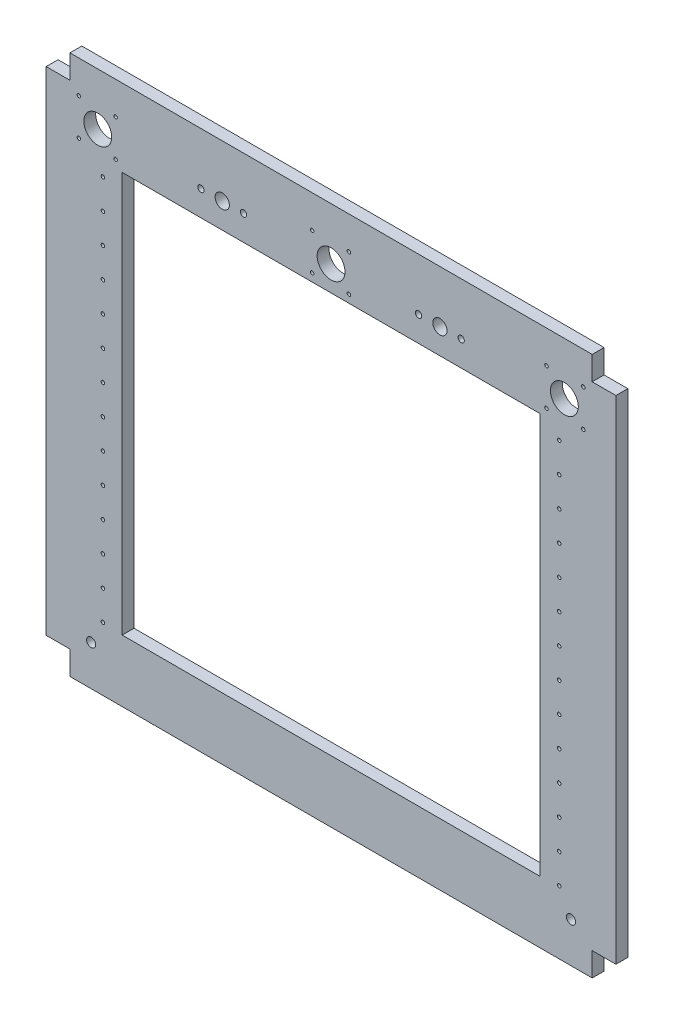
ISO-10303-21;
HEADER;
FILE_DESCRIPTION(('STEP AP214'),'2;1');
FILE_NAME('part.step','',(''),(''),'','','');
FILE_SCHEMA(('AUTOMOTIVE_DESIGN { 1 0 10303 214 1 1 1 1 }'));
ENDSEC;
DATA;
#1=APPLICATION_CONTEXT('core data for automotive mechanical design processes');
#2=APPLICATION_PROTOCOL_DEFINITION('international standard','automotive_design',2000,#1);
#3=PRODUCT_CONTEXT('',#1,'mechanical');
#4=PRODUCT('Part','Part','',(#3));
#5=PRODUCT_RELATED_PRODUCT_CATEGORY('part','',(#4));
#6=PRODUCT_DEFINITION_FORMATION('','',#4);
#7=PRODUCT_DEFINITION_CONTEXT('part definition',#1,'design');
#8=PRODUCT_DEFINITION('design','',#6,#7);
#9=PRODUCT_DEFINITION_SHAPE('','',#8);
#10=(LENGTH_UNIT() NAMED_UNIT(*) SI_UNIT(.MILLI.,.METRE.));
#11=(NAMED_UNIT(*) PLANE_ANGLE_UNIT() SI_UNIT($,.RADIAN.));
#12=(NAMED_UNIT(*) SI_UNIT($,.STERADIAN.) SOLID_ANGLE_UNIT());
#13=UNCERTAINTY_MEASURE_WITH_UNIT(LENGTH_MEASURE(1.E-05),#10,'distance_accuracy_value','');
#14=(GEOMETRIC_REPRESENTATION_CONTEXT(3) GLOBAL_UNCERTAINTY_ASSIGNED_CONTEXT((#13)) GLOBAL_UNIT_ASSIGNED_CONTEXT((#10,
#11,#12)) REPRESENTATION_CONTEXT('',''));
#15=CARTESIAN_POINT('',(0.,0.,0.));
#16=DIRECTION('',(0.,0.,1.));
#17=DIRECTION('',(1.,0.,0.));
#18=AXIS2_PLACEMENT_3D('',#15,#16,#17);
#19=CARTESIAN_POINT('',(0.,0.,10.));
#20=DIRECTION('',(0.,0.,-1.));
#21=DIRECTION('',(-1.,0.,0.));
#22=AXIS2_PLACEMENT_3D('',#19,#20,#21);
#23=PLANE('',#22);
#24=CARTESIAN_POINT('',(-73.75,183.55,10.));
#25=DIRECTION('',(0.,0.,1.));
#26=DIRECTION('',(-1.,0.,0.));
#27=AXIS2_PLACEMENT_3D('',#24,#25,#26);
#28=CIRCLE('',#27,2.65);
#29=CARTESIAN_POINT('',(-76.4,183.55,10.));
#30=VERTEX_POINT('',#29);
#31=EDGE_CURVE('E987',#30,#30,#28,.T.);
#32=ORIENTED_EDGE('',*,*,#31,.F.);
#33=EDGE_LOOP('',(#32));
#34=FACE_BOUND('',#33,.T.);
#35=CARTESIAN_POINT('',(73.75,183.55,10.));
#36=DIRECTION('',(0.,0.,1.));
#37=DIRECTION('',(1.,0.,0.));
#38=AXIS2_PLACEMENT_3D('',#35,#36,#37);
#39=CIRCLE('',#38,2.65);
#40=CARTESIAN_POINT('',(76.4,183.55,10.));
#41=VERTEX_POINT('',#40);
#42=EDGE_CURVE('E993',#41,#41,#39,.T.);
#43=ORIENTED_EDGE('',*,*,#42,.F.);
#44=EDGE_LOOP('',(#43));
#45=FACE_BOUND('',#44,.T.);
#46=CARTESIAN_POINT('',(109.65,183.55,10.));
#47=DIRECTION('',(0.,0.,1.));
#48=DIRECTION('',(-1.,0.,0.));
#49=AXIS2_PLACEMENT_3D('',#46,#47,#48);
#50=CIRCLE('',#49,2.65);
#51=CARTESIAN_POINT('',(107.,183.55,10.));
#52=VERTEX_POINT('',#51);
#53=EDGE_CURVE('E1002',#52,#52,#50,.T.);
#54=ORIENTED_EDGE('',*,*,#53,.F.);
#55=EDGE_LOOP('',(#54));
#56=FACE_BOUND('',#55,.T.);
#57=CARTESIAN_POINT('',(91.7,183.55,10.));
#58=DIRECTION('',(0.,0.,1.));
#59=DIRECTION('',(-1.,0.,0.));
#60=AXIS2_PLACEMENT_3D('',#57,#58,#59);
#61=CIRCLE('',#60,6.);
#62=CARTESIAN_POINT('',(85.7,183.55,10.));
#63=VERTEX_POINT('',#62);
#64=EDGE_CURVE('E1008',#63,#63,#61,.T.);
#65=ORIENTED_EDGE('',*,*,#64,.F.);
#66=EDGE_LOOP('',(#65));
#67=FACE_BOUND('',#66,.T.);
#68=CARTESIAN_POINT('',(-192.202807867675,100.886647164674,10.));
#69=DIRECTION('',(0.,0.,1.));
#70=DIRECTION('',(1.,0.,0.));
#71=AXIS2_PLACEMENT_3D('',#68,#69,#70);
#72=CIRCLE('',#71,1.5);
#73=CARTESIAN_POINT('',(-190.702807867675,100.886647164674,10.));
#74=VERTEX_POINT('',#73);
#75=EDGE_CURVE('E1022',#74,#74,#72,.T.);
#76=ORIENTED_EDGE('',*,*,#75,.F.);
#77=EDGE_LOOP('',(#76));
#78=FACE_BOUND('',#77,.T.);
#79=CARTESIAN_POINT('',(-192.202807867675,125.886647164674,10.));
#80=DIRECTION('',(0.,0.,1.));
#81=DIRECTION('',(1.,0.,0.));
#82=AXIS2_PLACEMENT_3D('',#79,#80,#81);
#83=CIRCLE('',#82,1.5);
#84=CARTESIAN_POINT('',(-190.702807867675,125.886647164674,10.));
#85=VERTEX_POINT('',#84);
#86=EDGE_CURVE('E1016',#85,#85,#83,.T.);
#87=ORIENTED_EDGE('',*,*,#86,.F.);
#88=EDGE_LOOP('',(#87));
#89=FACE_BOUND('',#88,.T.);
#90=CARTESIAN_POINT('',(-202.15,-193.65,10.));
#91=DIRECTION('',(0.,0.,1.));
#92=DIRECTION('',(1.,0.,0.));
#93=AXIS2_PLACEMENT_3D('',#90,#91,#92);
#94=CIRCLE('',#93,3.85);
#95=CARTESIAN_POINT('',(-198.3,-193.65,10.));
#96=VERTEX_POINT('',#95);
#97=EDGE_CURVE('E1015',#96,#96,#94,.T.);
#98=ORIENTED_EDGE('',*,*,#97,.F.);
#99=EDGE_LOOP('',(#98));
#100=FACE_BOUND('',#99,.T.);
#101=CARTESIAN_POINT('',(-192.202807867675,150.886647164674,10.));
#102=DIRECTION('',(0.,0.,1.));
#103=DIRECTION('',(1.,0.,0.));
#104=AXIS2_PLACEMENT_3D('',#101,#102,#103);
#105=CIRCLE('',#104,1.5);
#106=CARTESIAN_POINT('',(-190.702807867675,150.886647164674,10.));
#107=VERTEX_POINT('',#106);
#108=EDGE_CURVE('E1028',#107,#107,#105,.T.);
#109=ORIENTED_EDGE('',*,*,#108,.F.);
#110=EDGE_LOOP('',(#109));
#111=FACE_BOUND('',#110,.T.);
#112=CARTESIAN_POINT('',(192.202807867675,-74.1133528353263,10.));
#113=DIRECTION('',(0.,0.,1.));
#114=DIRECTION('',(-1.,0.,0.));
#115=AXIS2_PLACEMENT_3D('',#112,#113,#114);
#116=CIRCLE('',#115,1.5);
#117=CARTESIAN_POINT('',(190.702807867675,-74.1133528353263,10.));
#118=VERTEX_POINT('',#117);
#119=EDGE_CURVE('E1259',#118,#118,#116,.T.);
#120=ORIENTED_EDGE('',*,*,#119,.F.);
#121=EDGE_LOOP('',(#120));
#122=FACE_BOUND('',#121,.T.);
#123=CARTESIAN_POINT('',(192.202807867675,-99.1133528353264,10.));
#124=DIRECTION('',(0.,0.,1.));
#125=DIRECTION('',(-1.,0.,0.));
#126=AXIS2_PLACEMENT_3D('',#123,#124,#125);
#127=CIRCLE('',#126,1.5);
#128=CARTESIAN_POINT('',(190.702807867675,-99.1133528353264,10.));
#129=VERTEX_POINT('',#128);
#130=EDGE_CURVE('E1253',#129,#129,#127,.T.);
#131=ORIENTED_EDGE('',*,*,#130,.F.);
#132=EDGE_LOOP('',(#131));
#133=FACE_BOUND('',#132,.T.);
#134=CARTESIAN_POINT('',(192.202807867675,-124.113352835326,10.));
#135=DIRECTION('',(0.,0.,1.));
#136=DIRECTION('',(-1.,0.,0.));
#137=AXIS2_PLACEMENT_3D('',#134,#135,#136);
#138=CIRCLE('',#137,1.5);
#139=CARTESIAN_POINT('',(190.702807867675,-124.113352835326,10.));
#140=VERTEX_POINT('',#139);
#141=EDGE_CURVE('E1247',#140,#140,#138,.T.);
#142=ORIENTED_EDGE('',*,*,#141,.F.);
#143=EDGE_LOOP('',(#142));
#144=FACE_BOUND('',#143,.T.);
#145=CARTESIAN_POINT('',(192.202807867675,-149.113352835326,10.));
#146=DIRECTION('',(0.,0.,1.));
#147=DIRECTION('',(-1.,0.,0.));
#148=AXIS2_PLACEMENT_3D('',#145,#146,#147);
#149=CIRCLE('',#148,1.5);
#150=CARTESIAN_POINT('',(190.702807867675,-149.113352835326,10.));
#151=VERTEX_POINT('',#150);
#152=EDGE_CURVE('E1241',#151,#151,#149,.T.);
#153=ORIENTED_EDGE('',*,*,#152,.F.);
#154=EDGE_LOOP('',(#153));
#155=FACE_BOUND('',#154,.T.);
#156=CARTESIAN_POINT('',(192.202807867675,-174.113352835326,10.));
#157=DIRECTION('',(0.,0.,1.));
#158=DIRECTION('',(-1.,0.,0.));
#159=AXIS2_PLACEMENT_3D('',#156,#157,#158);
#160=CIRCLE('',#159,1.5);
#161=CARTESIAN_POINT('',(190.702807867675,-174.113352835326,10.));
#162=VERTEX_POINT('',#161);
#163=EDGE_CURVE('E1240',#162,#162,#160,.T.);
#164=ORIENTED_EDGE('',*,*,#163,.F.);
#165=EDGE_LOOP('',(#164));
#166=FACE_BOUND('',#165,.T.);
#167=CARTESIAN_POINT('',(202.15,-193.65,10.));
#168=DIRECTION('',(0.,0.,1.));
#169=DIRECTION('',(-1.,0.,0.));
#170=AXIS2_PLACEMENT_3D('',#167,#168,#169);
#171=CIRCLE('',#170,3.85);
#172=CARTESIAN_POINT('',(198.3,-193.65,10.));
#173=VERTEX_POINT('',#172);
#174=EDGE_CURVE('E1277',#173,#173,#171,.T.);
#175=ORIENTED_EDGE('',*,*,#174,.F.);
#176=EDGE_LOOP('',(#175));
#177=FACE_BOUND('',#176,.T.);
#178=CARTESIAN_POINT('',(-192.202807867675,50.8866471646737,10.));
#179=DIRECTION('',(0.,0.,1.));
#180=DIRECTION('',(1.,0.,0.));
#181=AXIS2_PLACEMENT_3D('',#178,#179,#180);
#182=CIRCLE('',#181,1.5);
#183=CARTESIAN_POINT('',(-190.702807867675,50.8866471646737,10.));
#184=VERTEX_POINT('',#183);
#185=EDGE_CURVE('E1271',#184,#184,#182,.T.);
#186=ORIENTED_EDGE('',*,*,#185,.F.);
#187=EDGE_LOOP('',(#186));
#188=FACE_BOUND('',#187,.T.);
#189=CARTESIAN_POINT('',(-192.202807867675,75.8866471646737,10.));
#190=DIRECTION('',(0.,0.,1.));
#191=DIRECTION('',(1.,0.,0.));
#192=AXIS2_PLACEMENT_3D('',#189,#190,#191);
#193=CIRCLE('',#192,1.5);
#194=CARTESIAN_POINT('',(-190.702807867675,75.8866471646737,10.));
#195=VERTEX_POINT('',#194);
#196=EDGE_CURVE('E1265',#195,#195,#193,.T.);
#197=ORIENTED_EDGE('',*,*,#196,.F.);
#198=EDGE_LOOP('',(#197));
#199=FACE_BOUND('',#198,.T.);
#200=CARTESIAN_POINT('',(-181.5,200.,10.));
#201=DIRECTION('',(0.,0.,1.));
#202=DIRECTION('',(1.,0.,0.));
#203=AXIS2_PLACEMENT_3D('',#200,#201,#202);
#204=CIRCLE('',#203,1.5);
#205=CARTESIAN_POINT('',(-180.,200.,10.));
#206=VERTEX_POINT('',#205);
#207=EDGE_CURVE('E1088',#206,#206,#204,.T.);
#208=ORIENTED_EDGE('',*,*,#207,.F.);
#209=EDGE_LOOP('',(#208));
#210=FACE_BOUND('',#209,.T.);
#211=CARTESIAN_POINT('',(-181.5,169.,10.));
#212=DIRECTION('',(0.,0.,1.));
#213=DIRECTION('',(1.,0.,0.));
#214=AXIS2_PLACEMENT_3D('',#211,#212,#213);
#215=CIRCLE('',#214,1.5);
#216=CARTESIAN_POINT('',(-180.,169.,10.));
#217=VERTEX_POINT('',#216);
#218=EDGE_CURVE('E1094',#217,#217,#215,.T.);
#219=ORIENTED_EDGE('',*,*,#218,.F.);
#220=EDGE_LOOP('',(#219));
#221=FACE_BOUND('',#220,.T.);
#222=CARTESIAN_POINT('',(-212.5,200.,10.));
#223=DIRECTION('',(0.,0.,1.));
#224=DIRECTION('',(1.,0.,0.));
#225=AXIS2_PLACEMENT_3D('',#222,#223,#224);
#226=CIRCLE('',#225,1.5);
#227=CARTESIAN_POINT('',(-211.,200.,10.));
#228=VERTEX_POINT('',#227);
#229=EDGE_CURVE('E1100',#228,#228,#226,.T.);
#230=ORIENTED_EDGE('',*,*,#229,.F.);
#231=EDGE_LOOP('',(#230));
#232=FACE_BOUND('',#231,.T.);
#233=CARTESIAN_POINT('',(-212.5,169.,10.));
#234=DIRECTION('',(0.,0.,1.));
#235=DIRECTION('',(1.,0.,0.));
#236=AXIS2_PLACEMENT_3D('',#233,#234,#235);
#237=CIRCLE('',#236,1.5);
#238=CARTESIAN_POINT('',(-211.,169.,10.));
#239=VERTEX_POINT('',#238);
#240=EDGE_CURVE('E1106',#239,#239,#237,.T.);
#241=ORIENTED_EDGE('',*,*,#240,.F.);
#242=EDGE_LOOP('',(#241));
#243=FACE_BOUND('',#242,.T.);
#244=CARTESIAN_POINT('',(196.55,183.55,10.));
#245=DIRECTION('',(0.,0.,1.));
#246=DIRECTION('',(-1.,0.,0.));
#247=AXIS2_PLACEMENT_3D('',#244,#245,#246);
#248=CIRCLE('',#247,11.75);
#249=CARTESIAN_POINT('',(184.8,183.55,10.));
#250=VERTEX_POINT('',#249);
#251=EDGE_CURVE('E1112',#250,#250,#248,.T.);
#252=ORIENTED_EDGE('',*,*,#251,.F.);
#253=EDGE_LOOP('',(#252));
#254=FACE_BOUND('',#253,.T.);
#255=CARTESIAN_POINT('',(212.5,169.,10.));
#256=DIRECTION('',(0.,0.,1.));
#257=DIRECTION('',(-1.,0.,0.));
#258=AXIS2_PLACEMENT_3D('',#255,#256,#257);
#259=CIRCLE('',#258,1.5);
#260=CARTESIAN_POINT('',(211.,169.,10.));
#261=VERTEX_POINT('',#260);
#262=EDGE_CURVE('E1118',#261,#261,#259,.T.);
#263=ORIENTED_EDGE('',*,*,#262,.F.);
#264=EDGE_LOOP('',(#263));
#265=FACE_BOUND('',#264,.T.);
#266=CARTESIAN_POINT('',(181.5,169.,10.));
#267=DIRECTION('',(0.,0.,1.));
#268=DIRECTION('',(-1.,0.,0.));
#269=AXIS2_PLACEMENT_3D('',#266,#267,#268);
#270=CIRCLE('',#269,1.5);
#271=CARTESIAN_POINT('',(180.,169.,10.));
#272=VERTEX_POINT('',#271);
#273=EDGE_CURVE('E1124',#272,#272,#270,.T.);
#274=ORIENTED_EDGE('',*,*,#273,.F.);
#275=EDGE_LOOP('',(#274));
#276=FACE_BOUND('',#275,.T.);
#277=CARTESIAN_POINT('',(181.5,200.,10.));
#278=DIRECTION('',(0.,0.,1.));
#279=DIRECTION('',(-1.,0.,0.));
#280=AXIS2_PLACEMENT_3D('',#277,#278,#279);
#281=CIRCLE('',#280,1.5);
#282=CARTESIAN_POINT('',(180.,200.,10.));
#283=VERTEX_POINT('',#282);
#284=EDGE_CURVE('E1075',#283,#283,#281,.T.);
#285=ORIENTED_EDGE('',*,*,#284,.F.);
#286=EDGE_LOOP('',(#285));
#287=FACE_BOUND('',#286,.T.);
#288=CARTESIAN_POINT('',(-91.7,183.55,10.));
#289=DIRECTION('',(0.,0.,1.));
#290=DIRECTION('',(1.,0.,0.));
#291=AXIS2_PLACEMENT_3D('',#288,#289,#290);
#292=CIRCLE('',#291,6.);
#293=CARTESIAN_POINT('',(-85.7,183.55,10.));
#294=VERTEX_POINT('',#293);
#295=EDGE_CURVE('E990',#294,#294,#292,.T.);
#296=ORIENTED_EDGE('',*,*,#295,.F.);
#297=EDGE_LOOP('',(#296));
#298=FACE_BOUND('',#297,.T.);
#299=CARTESIAN_POINT('',(-109.65,183.55,10.));
#300=DIRECTION('',(0.,0.,1.));
#301=DIRECTION('',(1.,0.,0.));
#302=AXIS2_PLACEMENT_3D('',#299,#300,#301);
#303=CIRCLE('',#302,2.65);
#304=CARTESIAN_POINT('',(-107.,183.55,10.));
#305=VERTEX_POINT('',#304);
#306=EDGE_CURVE('E1052',#305,#305,#303,.T.);
#307=ORIENTED_EDGE('',*,*,#306,.F.);
#308=EDGE_LOOP('',(#307));
#309=FACE_BOUND('',#308,.T.);
#310=CARTESIAN_POINT('',(-15.95,169.,10.));
#311=DIRECTION('',(0.,0.,1.));
#312=DIRECTION('',(1.,0.,0.));
#313=AXIS2_PLACEMENT_3D('',#310,#311,#312);
#314=CIRCLE('',#313,1.5);
#315=CARTESIAN_POINT('',(-14.45,169.,10.));
#316=VERTEX_POINT('',#315);
#317=EDGE_CURVE('E1046',#316,#316,#314,.T.);
#318=ORIENTED_EDGE('',*,*,#317,.F.);
#319=EDGE_LOOP('',(#318));
#320=FACE_BOUND('',#319,.T.);
#321=CARTESIAN_POINT('',(15.05,169.,10.));
#322=DIRECTION('',(0.,0.,1.));
#323=DIRECTION('',(1.,0.,0.));
#324=AXIS2_PLACEMENT_3D('',#321,#322,#323);
#325=CIRCLE('',#324,1.5);
#326=CARTESIAN_POINT('',(16.55,169.,10.));
#327=VERTEX_POINT('',#326);
#328=EDGE_CURVE('E1040',#327,#327,#325,.T.);
#329=ORIENTED_EDGE('',*,*,#328,.F.);
#330=EDGE_LOOP('',(#329));
#331=FACE_BOUND('',#330,.T.);
#332=CARTESIAN_POINT('',(212.5,200.,10.));
#333=DIRECTION('',(0.,0.,1.));
#334=DIRECTION('',(-1.,0.,0.));
#335=AXIS2_PLACEMENT_3D('',#332,#333,#334);
#336=CIRCLE('',#335,1.5);
#337=CARTESIAN_POINT('',(211.,200.,10.));
#338=VERTEX_POINT('',#337);
#339=EDGE_CURVE('E1076',#338,#338,#336,.T.);
#340=ORIENTED_EDGE('',*,*,#339,.F.);
#341=EDGE_LOOP('',(#340));
#342=FACE_BOUND('',#341,.T.);
#343=CARTESIAN_POINT('',(0.,183.55,10.));
#344=DIRECTION('',(0.,0.,1.));
#345=DIRECTION('',(1.,0.,0.));
#346=AXIS2_PLACEMENT_3D('',#343,#344,#345);
#347=CIRCLE('',#346,11.75);
#348=CARTESIAN_POINT('',(11.75,183.55,10.));
#349=VERTEX_POINT('',#348);
#350=EDGE_CURVE('E1063',#349,#349,#347,.T.);
#351=ORIENTED_EDGE('',*,*,#350,.F.);
#352=EDGE_LOOP('',(#351));
#353=FACE_BOUND('',#352,.T.);
#354=CARTESIAN_POINT('',(-15.95,200.,10.));
#355=DIRECTION('',(0.,0.,1.));
#356=DIRECTION('',(1.,0.,0.));
#357=AXIS2_PLACEMENT_3D('',#354,#355,#356);
#358=CIRCLE('',#357,1.5);
#359=CARTESIAN_POINT('',(-14.45,200.,10.));
#360=VERTEX_POINT('',#359);
#361=EDGE_CURVE('E1064',#360,#360,#358,.T.);
#362=ORIENTED_EDGE('',*,*,#361,.F.);
#363=EDGE_LOOP('',(#362));
#364=FACE_BOUND('',#363,.T.);
#365=CARTESIAN_POINT('',(15.05,200.,10.));
#366=DIRECTION('',(0.,0.,1.));
#367=DIRECTION('',(1.,0.,0.));
#368=AXIS2_PLACEMENT_3D('',#365,#366,#367);
#369=CIRCLE('',#368,1.5);
#370=CARTESIAN_POINT('',(16.55,200.,10.));
#371=VERTEX_POINT('',#370);
#372=EDGE_CURVE('E1039',#371,#371,#369,.T.);
#373=ORIENTED_EDGE('',*,*,#372,.F.);
#374=EDGE_LOOP('',(#373));
#375=FACE_BOUND('',#374,.T.);
#376=CARTESIAN_POINT('',(192.202807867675,100.886647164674,10.));
#377=DIRECTION('',(0.,0.,1.));
#378=DIRECTION('',(-1.,0.,0.));
#379=AXIS2_PLACEMENT_3D('',#376,#377,#378);
#380=CIRCLE('',#379,1.5);
#381=CARTESIAN_POINT('',(190.702807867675,100.886647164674,10.));
#382=VERTEX_POINT('',#381);
#383=EDGE_CURVE('E1162',#382,#382,#380,.T.);
#384=ORIENTED_EDGE('',*,*,#383,.F.);
#385=EDGE_LOOP('',(#384));
#386=FACE_BOUND('',#385,.T.);
#387=CARTESIAN_POINT('',(192.202807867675,75.8866471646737,10.));
#388=DIRECTION('',(0.,0.,1.));
#389=DIRECTION('',(-1.,0.,0.));
#390=AXIS2_PLACEMENT_3D('',#387,#388,#389);
#391=CIRCLE('',#390,1.5);
#392=CARTESIAN_POINT('',(190.702807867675,75.8866471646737,10.));
#393=VERTEX_POINT('',#392);
#394=EDGE_CURVE('E1166',#393,#393,#391,.T.);
#395=ORIENTED_EDGE('',*,*,#394,.F.);
#396=EDGE_LOOP('',(#395));
#397=FACE_BOUND('',#396,.T.);
#398=CARTESIAN_POINT('',(192.202807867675,50.8866471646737,10.));
#399=DIRECTION('',(0.,0.,1.));
#400=DIRECTION('',(-1.,0.,0.));
#401=AXIS2_PLACEMENT_3D('',#398,#399,#400);
#402=CIRCLE('',#401,1.5);
#403=CARTESIAN_POINT('',(190.702807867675,50.8866471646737,10.));
#404=VERTEX_POINT('',#403);
#405=EDGE_CURVE('E1170',#404,#404,#402,.T.);
#406=ORIENTED_EDGE('',*,*,#405,.F.);
#407=EDGE_LOOP('',(#406));
#408=FACE_BOUND('',#407,.T.);
#409=CARTESIAN_POINT('',(192.202807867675,25.8866471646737,10.));
#410=DIRECTION('',(0.,0.,1.));
#411=DIRECTION('',(-1.,0.,0.));
#412=AXIS2_PLACEMENT_3D('',#409,#410,#411);
#413=CIRCLE('',#412,1.5);
#414=CARTESIAN_POINT('',(190.702807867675,25.8866471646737,10.));
#415=VERTEX_POINT('',#414);
#416=EDGE_CURVE('E1174',#415,#415,#413,.T.);
#417=ORIENTED_EDGE('',*,*,#416,.F.);
#418=EDGE_LOOP('',(#417));
#419=FACE_BOUND('',#418,.T.);
#420=CARTESIAN_POINT('',(-192.202807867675,-124.113352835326,10.));
#421=DIRECTION('',(0.,0.,1.));
#422=DIRECTION('',(1.,0.,0.));
#423=AXIS2_PLACEMENT_3D('',#420,#421,#422);
#424=CIRCLE('',#423,1.5);
#425=CARTESIAN_POINT('',(-190.702807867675,-124.113352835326,10.));
#426=VERTEX_POINT('',#425);
#427=EDGE_CURVE('E1178',#426,#426,#424,.T.);
#428=ORIENTED_EDGE('',*,*,#427,.F.);
#429=EDGE_LOOP('',(#428));
#430=FACE_BOUND('',#429,.T.);
#431=CARTESIAN_POINT('',(-192.202807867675,-149.113352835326,10.));
#432=DIRECTION('',(0.,0.,1.));
#433=DIRECTION('',(1.,0.,0.));
#434=AXIS2_PLACEMENT_3D('',#431,#432,#433);
#435=CIRCLE('',#434,1.5);
#436=CARTESIAN_POINT('',(-190.702807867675,-149.113352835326,10.));
#437=VERTEX_POINT('',#436);
#438=EDGE_CURVE('E1182',#437,#437,#435,.T.);
#439=ORIENTED_EDGE('',*,*,#438,.F.);
#440=EDGE_LOOP('',(#439));
#441=FACE_BOUND('',#440,.T.);
#442=CARTESIAN_POINT('',(-192.202807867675,-174.113352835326,10.));
#443=DIRECTION('',(0.,0.,1.));
#444=DIRECTION('',(1.,0.,0.));
#445=AXIS2_PLACEMENT_3D('',#442,#443,#444);
#446=CIRCLE('',#445,1.5);
#447=CARTESIAN_POINT('',(-190.702807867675,-174.113352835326,10.));
#448=VERTEX_POINT('',#447);
#449=EDGE_CURVE('E1186',#448,#448,#446,.T.);
#450=ORIENTED_EDGE('',*,*,#449,.F.);
#451=EDGE_LOOP('',(#450));
#452=FACE_BOUND('',#451,.T.);
#453=CARTESIAN_POINT('',(192.202807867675,0.886647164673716,10.));
#454=DIRECTION('',(0.,0.,1.));
#455=DIRECTION('',(-1.,0.,0.));
#456=AXIS2_PLACEMENT_3D('',#453,#454,#455);
#457=CIRCLE('',#456,1.5);
#458=CARTESIAN_POINT('',(190.702807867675,0.886647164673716,10.));
#459=VERTEX_POINT('',#458);
#460=EDGE_CURVE('E1190',#459,#459,#457,.T.);
#461=ORIENTED_EDGE('',*,*,#460,.F.);
#462=EDGE_LOOP('',(#461));
#463=FACE_BOUND('',#462,.T.);
#464=CARTESIAN_POINT('',(192.202807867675,-24.1133528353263,10.));
#465=DIRECTION('',(0.,0.,1.));
#466=DIRECTION('',(-1.,0.,0.));
#467=AXIS2_PLACEMENT_3D('',#464,#465,#466);
#468=CIRCLE('',#467,1.5);
#469=CARTESIAN_POINT('',(190.702807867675,-24.1133528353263,10.));
#470=VERTEX_POINT('',#469);
#471=EDGE_CURVE('E1194',#470,#470,#468,.T.);
#472=ORIENTED_EDGE('',*,*,#471,.F.);
#473=EDGE_LOOP('',(#472));
#474=FACE_BOUND('',#473,.T.);
#475=CARTESIAN_POINT('',(-192.202807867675,0.886647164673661,10.));
#476=DIRECTION('',(0.,0.,1.));
#477=DIRECTION('',(1.,0.,0.));
#478=AXIS2_PLACEMENT_3D('',#475,#476,#477);
#479=CIRCLE('',#478,1.5);
#480=CARTESIAN_POINT('',(-190.702807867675,0.886647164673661,10.));
#481=VERTEX_POINT('',#480);
#482=EDGE_CURVE('E1198',#481,#481,#479,.T.);
#483=ORIENTED_EDGE('',*,*,#482,.F.);
#484=EDGE_LOOP('',(#483));
#485=FACE_BOUND('',#484,.T.);
#486=CARTESIAN_POINT('',(-192.202807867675,25.8866471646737,10.));
#487=DIRECTION('',(0.,0.,1.));
#488=DIRECTION('',(1.,0.,0.));
#489=AXIS2_PLACEMENT_3D('',#486,#487,#488);
#490=CIRCLE('',#489,1.5);
#491=CARTESIAN_POINT('',(-190.702807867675,25.8866471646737,10.));
#492=VERTEX_POINT('',#491);
#493=EDGE_CURVE('E1202',#492,#492,#490,.T.);
#494=ORIENTED_EDGE('',*,*,#493,.F.);
#495=EDGE_LOOP('',(#494));
#496=FACE_BOUND('',#495,.T.);
#497=CARTESIAN_POINT('',(192.202807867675,-49.1133528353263,10.));
#498=DIRECTION('',(0.,0.,1.));
#499=DIRECTION('',(-1.,0.,0.));
#500=AXIS2_PLACEMENT_3D('',#497,#498,#499);
#501=CIRCLE('',#500,1.5);
#502=CARTESIAN_POINT('',(190.702807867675,-49.1133528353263,10.));
#503=VERTEX_POINT('',#502);
#504=EDGE_CURVE('E1206',#503,#503,#501,.T.);
#505=ORIENTED_EDGE('',*,*,#504,.F.);
#506=EDGE_LOOP('',(#505));
#507=FACE_BOUND('',#506,.T.);
#508=CARTESIAN_POINT('',(-192.202807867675,-24.1133528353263,10.));
#509=DIRECTION('',(0.,0.,1.));
#510=DIRECTION('',(1.,0.,0.));
#511=AXIS2_PLACEMENT_3D('',#508,#509,#510);
#512=CIRCLE('',#511,1.5);
#513=CARTESIAN_POINT('',(-190.702807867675,-24.1133528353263,10.));
#514=VERTEX_POINT('',#513);
#515=EDGE_CURVE('E1210',#514,#514,#512,.T.);
#516=ORIENTED_EDGE('',*,*,#515,.F.);
#517=EDGE_LOOP('',(#516));
#518=FACE_BOUND('',#517,.T.);
#519=CARTESIAN_POINT('',(-192.202807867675,-49.1133528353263,10.));
#520=DIRECTION('',(0.,0.,1.));
#521=DIRECTION('',(1.,0.,0.));
#522=AXIS2_PLACEMENT_3D('',#519,#520,#521);
#523=CIRCLE('',#522,1.5);
#524=CARTESIAN_POINT('',(-190.702807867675,-49.1133528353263,10.));
#525=VERTEX_POINT('',#524);
#526=EDGE_CURVE('E1214',#525,#525,#523,.T.);
#527=ORIENTED_EDGE('',*,*,#526,.F.);
#528=EDGE_LOOP('',(#527));
#529=FACE_BOUND('',#528,.T.);
#530=CARTESIAN_POINT('',(-192.202807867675,-74.1133528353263,10.));
#531=DIRECTION('',(0.,0.,1.));
#532=DIRECTION('',(1.,0.,0.));
#533=AXIS2_PLACEMENT_3D('',#530,#531,#532);
#534=CIRCLE('',#533,1.5);
#535=CARTESIAN_POINT('',(-190.702807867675,-74.1133528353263,10.));
#536=VERTEX_POINT('',#535);
#537=EDGE_CURVE('E1218',#536,#536,#534,.T.);
#538=ORIENTED_EDGE('',*,*,#537,.F.);
#539=EDGE_LOOP('',(#538));
#540=FACE_BOUND('',#539,.T.);
#541=CARTESIAN_POINT('',(-192.202807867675,-99.1133528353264,10.));
#542=DIRECTION('',(0.,0.,1.));
#543=DIRECTION('',(1.,0.,0.));
#544=AXIS2_PLACEMENT_3D('',#541,#542,#543);
#545=CIRCLE('',#544,1.5);
#546=CARTESIAN_POINT('',(-190.702807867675,-99.1133528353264,10.));
#547=VERTEX_POINT('',#546);
#548=EDGE_CURVE('E1222',#547,#547,#545,.T.);
#549=ORIENTED_EDGE('',*,*,#548,.F.);
#550=EDGE_LOOP('',(#549));
#551=FACE_BOUND('',#550,.T.);
#552=CARTESIAN_POINT('',(192.202807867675,125.886647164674,10.));
#553=DIRECTION('',(0.,0.,1.));
#554=DIRECTION('',(-1.,0.,0.));
#555=AXIS2_PLACEMENT_3D('',#552,#553,#554);
#556=CIRCLE('',#555,1.5);
#557=CARTESIAN_POINT('',(190.702807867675,125.886647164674,10.));
#558=VERTEX_POINT('',#557);
#559=EDGE_CURVE('E1226',#558,#558,#556,.T.);
#560=ORIENTED_EDGE('',*,*,#559,.F.);
#561=EDGE_LOOP('',(#560));
#562=FACE_BOUND('',#561,.T.);
#563=CARTESIAN_POINT('',(192.202807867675,150.886647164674,10.));
#564=DIRECTION('',(0.,0.,1.));
#565=DIRECTION('',(-1.,0.,0.));
#566=AXIS2_PLACEMENT_3D('',#563,#564,#565);
#567=CIRCLE('',#566,1.5);
#568=CARTESIAN_POINT('',(190.702807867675,150.886647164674,10.));
#569=VERTEX_POINT('',#568);
#570=EDGE_CURVE('E1229',#569,#569,#567,.T.);
#571=ORIENTED_EDGE('',*,*,#570,.F.);
#572=EDGE_LOOP('',(#571));
#573=FACE_BOUND('',#572,.T.);
#574=CARTESIAN_POINT('',(-196.55,183.55,10.));
#575=DIRECTION('',(0.,0.,1.));
#576=DIRECTION('',(1.,0.,0.));
#577=AXIS2_PLACEMENT_3D('',#574,#575,#576);
#578=CIRCLE('',#577,11.75);
#579=CARTESIAN_POINT('',(-184.8,183.55,10.));
#580=VERTEX_POINT('',#579);
#581=EDGE_CURVE('E1087',#580,#580,#578,.T.);
#582=ORIENTED_EDGE('',*,*,#581,.F.);
#583=EDGE_LOOP('',(#582));
#584=FACE_BOUND('',#583,.T.);
#585=DIRECTION('',(-1.,0.,0.));
#586=VECTOR('',#585,1.);
#587=CARTESIAN_POINT('',(-220.,227.5,10.));
#588=LINE('',#587,#586);
#589=CARTESIAN_POINT('',(220.,227.5,10.));
#590=VERTEX_POINT('',#589);
#591=CARTESIAN_POINT('',(-220.,227.5,10.));
#592=VERTEX_POINT('',#591);
#593=EDGE_CURVE('E183',#590,#592,#588,.T.);
#594=ORIENTED_EDGE('',*,*,#593,.T.);
#595=DIRECTION('',(0.,-1.,0.));
#596=VECTOR('',#595,1.);
#597=CARTESIAN_POINT('',(-220.,227.5,10.));
#598=LINE('',#597,#596);
#599=CARTESIAN_POINT('',(-220.,207.5,10.));
#600=VERTEX_POINT('',#599);
#601=EDGE_CURVE('E186',#592,#600,#598,.T.);
#602=ORIENTED_EDGE('',*,*,#601,.T.);
#603=DIRECTION('',(-1.,0.,0.));
#604=VECTOR('',#603,1.);
#605=CARTESIAN_POINT('',(-220.,207.5,10.));
#606=LINE('',#605,#604);
#607=CARTESIAN_POINT('',(-240.,207.5,10.));
#608=VERTEX_POINT('',#607);
#609=EDGE_CURVE('E189',#600,#608,#606,.T.);
#610=ORIENTED_EDGE('',*,*,#609,.T.);
#611=DIRECTION('',(0.,-1.,0.));
#612=VECTOR('',#611,1.);
#613=CARTESIAN_POINT('',(-240.,-207.5,10.));
#614=LINE('',#613,#612);
#615=CARTESIAN_POINT('',(-240.,-207.5,10.));
#616=VERTEX_POINT('',#615);
#617=EDGE_CURVE('E191',#608,#616,#614,.T.);
#618=ORIENTED_EDGE('',*,*,#617,.T.);
#619=DIRECTION('',(1.,0.,0.));
#620=VECTOR('',#619,1.);
#621=CARTESIAN_POINT('',(-220.,-207.5,10.));
#622=LINE('',#621,#620);
#623=CARTESIAN_POINT('',(-220.,-207.5,10.));
#624=VERTEX_POINT('',#623);
#625=EDGE_CURVE('E193',#616,#624,#622,.T.);
#626=ORIENTED_EDGE('',*,*,#625,.T.);
#627=DIRECTION('',(0.,-1.,0.));
#628=VECTOR('',#627,1.);
#629=CARTESIAN_POINT('',(-220.,-227.5,10.));
#630=LINE('',#629,#628);
#631=CARTESIAN_POINT('',(-220.,-227.5,10.));
#632=VERTEX_POINT('',#631);
#633=EDGE_CURVE('E195',#624,#632,#630,.T.);
#634=ORIENTED_EDGE('',*,*,#633,.T.);
#635=DIRECTION('',(1.,0.,0.));
#636=VECTOR('',#635,1.);
#637=CARTESIAN_POINT('',(220.,-227.5,10.));
#638=LINE('',#637,#636);
#639=CARTESIAN_POINT('',(220.,-227.5,10.));
#640=VERTEX_POINT('',#639);
#641=EDGE_CURVE('E197',#632,#640,#638,.T.);
#642=ORIENTED_EDGE('',*,*,#641,.T.);
#643=DIRECTION('',(0.,1.,0.));
#644=VECTOR('',#643,1.);
#645=CARTESIAN_POINT('',(220.,-227.5,10.));
#646=LINE('',#645,#644);
#647=CARTESIAN_POINT('',(220.,-207.5,10.));
#648=VERTEX_POINT('',#647);
#649=EDGE_CURVE('E199',#640,#648,#646,.T.);
#650=ORIENTED_EDGE('',*,*,#649,.T.);
#651=DIRECTION('',(1.,0.,0.));
#652=VECTOR('',#651,1.);
#653=CARTESIAN_POINT('',(220.,-207.5,10.));
#654=LINE('',#653,#652);
#655=CARTESIAN_POINT('',(240.,-207.5,10.));
#656=VERTEX_POINT('',#655);
#657=EDGE_CURVE('E201',#648,#656,#654,.T.);
#658=ORIENTED_EDGE('',*,*,#657,.T.);
#659=DIRECTION('',(0.,1.,0.));
#660=VECTOR('',#659,1.);
#661=CARTESIAN_POINT('',(240.,207.5,10.));
#662=LINE('',#661,#660);
#663=CARTESIAN_POINT('',(240.,207.5,10.));
#664=VERTEX_POINT('',#663);
#665=EDGE_CURVE('E203',#656,#664,#662,.T.);
#666=ORIENTED_EDGE('',*,*,#665,.T.);
#667=DIRECTION('',(-1.,0.,0.));
#668=VECTOR('',#667,1.);
#669=CARTESIAN_POINT('',(220.,207.5,10.));
#670=LINE('',#669,#668);
#671=CARTESIAN_POINT('',(220.,207.5,10.));
#672=VERTEX_POINT('',#671);
#673=EDGE_CURVE('E205',#664,#672,#670,.T.);
#674=ORIENTED_EDGE('',*,*,#673,.T.);
#675=DIRECTION('',(0.,1.,0.));
#676=VECTOR('',#675,1.);
#677=CARTESIAN_POINT('',(220.,227.5,10.));
#678=LINE('',#677,#676);
#679=EDGE_CURVE('E207',#672,#590,#678,.T.);
#680=ORIENTED_EDGE('',*,*,#679,.T.);
#681=EDGE_LOOP('',(#594,#602,#610,#618,#626,#634,#642,#650,#658,#666,#674,#680));
#682=FACE_BOUND('',#681,.T.);
#683=DIRECTION('',(0.,-1.,0.));
#684=VECTOR('',#683,1.);
#685=CARTESIAN_POINT('',(-176.,162.3,10.));
#686=LINE('',#685,#684);
#687=CARTESIAN_POINT('',(-176.,162.3,10.));
#688=VERTEX_POINT('',#687);
#689=CARTESIAN_POINT('',(-176.,-175.3,10.));
#690=VERTEX_POINT('',#689);
#691=EDGE_CURVE('E145',#688,#690,#686,.T.);
#692=ORIENTED_EDGE('',*,*,#691,.F.);
#693=DIRECTION('',(-1.,0.,0.));
#694=VECTOR('',#693,1.);
#695=CARTESIAN_POINT('',(-176.,162.3,10.));
#696=LINE('',#695,#694);
#697=CARTESIAN_POINT('',(176.,162.3,10.));
#698=VERTEX_POINT('',#697);
#699=EDGE_CURVE('E167',#698,#688,#696,.T.);
#700=ORIENTED_EDGE('',*,*,#699,.F.);
#701=DIRECTION('',(0.,1.,0.));
#702=VECTOR('',#701,1.);
#703=CARTESIAN_POINT('',(176.,162.3,10.));
#704=LINE('',#703,#702);
#705=CARTESIAN_POINT('',(176.,-175.3,10.));
#706=VERTEX_POINT('',#705);
#707=EDGE_CURVE('E165',#706,#698,#704,.T.);
#708=ORIENTED_EDGE('',*,*,#707,.F.);
#709=DIRECTION('',(1.,0.,0.));
#710=VECTOR('',#709,1.);
#711=CARTESIAN_POINT('',(-176.,-175.3,10.));
#712=LINE('',#711,#710);
#713=EDGE_CURVE('E153',#690,#706,#712,.T.);
#714=ORIENTED_EDGE('',*,*,#713,.F.);
#715=EDGE_LOOP('',(#692,#700,#708,#714));
#716=FACE_BOUND('',#715,.T.);
#717=ADVANCED_FACE('F32',(#34,#45,#56,#67,#78,#89,#100,#111,#122,#133,#144,#155,#166,#177,#188,
#199,#210,#221,#232,#243,#254,#265,#276,#287,#298,#309,#320,#331,#342,#353,#364,#375,#386,#397,
#408,#419,#430,#441,#452,#463,#474,#485,#496,#507,#518,#529,#540,#551,#562,#573,#584,#682,#716),
#23,.F.);
#718=CARTESIAN_POINT('',(0.,0.,0.));
#719=DIRECTION('',(0.,0.,-1.));
#720=DIRECTION('',(-1.,0.,0.));
#721=AXIS2_PLACEMENT_3D('',#718,#719,#720);
#722=PLANE('',#721);
#723=CARTESIAN_POINT('',(-73.75,183.55,0.));
#724=DIRECTION('',(0.,0.,1.));
#725=DIRECTION('',(-1.,0.,0.));
#726=AXIS2_PLACEMENT_3D('',#723,#724,#725);
#727=CIRCLE('',#726,2.65);
#728=CARTESIAN_POINT('',(-76.4,183.55,0.));
#729=VERTEX_POINT('',#728);
#730=EDGE_CURVE('E985',#729,#729,#727,.T.);
#731=ORIENTED_EDGE('',*,*,#730,.T.);
#732=EDGE_LOOP('',(#731));
#733=FACE_BOUND('',#732,.T.);
#734=CARTESIAN_POINT('',(73.75,183.55,0.));
#735=DIRECTION('',(0.,0.,1.));
#736=DIRECTION('',(1.,0.,0.));
#737=AXIS2_PLACEMENT_3D('',#734,#735,#736);
#738=CIRCLE('',#737,2.65);
#739=CARTESIAN_POINT('',(76.4,183.55,0.));
#740=VERTEX_POINT('',#739);
#741=EDGE_CURVE('E988',#740,#740,#738,.T.);
#742=ORIENTED_EDGE('',*,*,#741,.T.);
#743=EDGE_LOOP('',(#742));
#744=FACE_BOUND('',#743,.T.);
#745=CARTESIAN_POINT('',(109.65,183.55,0.));
#746=DIRECTION('',(0.,0.,1.));
#747=DIRECTION('',(-1.,0.,0.));
#748=AXIS2_PLACEMENT_3D('',#745,#746,#747);
#749=CIRCLE('',#748,2.65);
#750=CARTESIAN_POINT('',(107.,183.55,0.));
#751=VERTEX_POINT('',#750);
#752=EDGE_CURVE('E999',#751,#751,#749,.T.);
#753=ORIENTED_EDGE('',*,*,#752,.T.);
#754=EDGE_LOOP('',(#753));
#755=FACE_BOUND('',#754,.T.);
#756=CARTESIAN_POINT('',(91.7,183.55,0.));
#757=DIRECTION('',(0.,0.,1.));
#758=DIRECTION('',(-1.,0.,0.));
#759=AXIS2_PLACEMENT_3D('',#756,#757,#758);
#760=CIRCLE('',#759,6.);
#761=CARTESIAN_POINT('',(85.7,183.55,0.));
#762=VERTEX_POINT('',#761);
#763=EDGE_CURVE('E1005',#762,#762,#760,.T.);
#764=ORIENTED_EDGE('',*,*,#763,.T.);
#765=EDGE_LOOP('',(#764));
#766=FACE_BOUND('',#765,.T.);
#767=CARTESIAN_POINT('',(-192.202807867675,100.886647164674,0.));
#768=DIRECTION('',(0.,0.,1.));
#769=DIRECTION('',(1.,0.,0.));
#770=AXIS2_PLACEMENT_3D('',#767,#768,#769);
#771=CIRCLE('',#770,1.5);
#772=CARTESIAN_POINT('',(-190.702807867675,100.886647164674,0.));
#773=VERTEX_POINT('',#772);
#774=EDGE_CURVE('E1019',#773,#773,#771,.T.);
#775=ORIENTED_EDGE('',*,*,#774,.T.);
#776=EDGE_LOOP('',(#775));
#777=FACE_BOUND('',#776,.T.);
#778=CARTESIAN_POINT('',(-192.202807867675,125.886647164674,0.));
#779=DIRECTION('',(0.,0.,1.));
#780=DIRECTION('',(1.,0.,0.));
#781=AXIS2_PLACEMENT_3D('',#778,#779,#780);
#782=CIRCLE('',#781,1.5);
#783=CARTESIAN_POINT('',(-190.702807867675,125.886647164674,0.));
#784=VERTEX_POINT('',#783);
#785=EDGE_CURVE('E1012',#784,#784,#782,.T.);
#786=ORIENTED_EDGE('',*,*,#785,.T.);
#787=EDGE_LOOP('',(#786));
#788=FACE_BOUND('',#787,.T.);
#789=CARTESIAN_POINT('',(-202.15,-193.65,0.));
#790=DIRECTION('',(0.,0.,1.));
#791=DIRECTION('',(1.,0.,0.));
#792=AXIS2_PLACEMENT_3D('',#789,#790,#791);
#793=CIRCLE('',#792,3.85);
#794=CARTESIAN_POINT('',(-198.3,-193.65,0.));
#795=VERTEX_POINT('',#794);
#796=EDGE_CURVE('E1031',#795,#795,#793,.T.);
#797=ORIENTED_EDGE('',*,*,#796,.T.);
#798=EDGE_LOOP('',(#797));
#799=FACE_BOUND('',#798,.T.);
#800=CARTESIAN_POINT('',(-192.202807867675,150.886647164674,0.));
#801=DIRECTION('',(0.,0.,1.));
#802=DIRECTION('',(1.,0.,0.));
#803=AXIS2_PLACEMENT_3D('',#800,#801,#802);
#804=CIRCLE('',#803,1.5);
#805=CARTESIAN_POINT('',(-190.702807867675,150.886647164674,0.));
#806=VERTEX_POINT('',#805);
#807=EDGE_CURVE('E1011',#806,#806,#804,.T.);
#808=ORIENTED_EDGE('',*,*,#807,.T.);
#809=EDGE_LOOP('',(#808));
#810=FACE_BOUND('',#809,.T.);
#811=CARTESIAN_POINT('',(192.202807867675,-74.1133528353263,0.));
#812=DIRECTION('',(0.,0.,1.));
#813=DIRECTION('',(-1.,0.,0.));
#814=AXIS2_PLACEMENT_3D('',#811,#812,#813);
#815=CIRCLE('',#814,1.5);
#816=CARTESIAN_POINT('',(190.702807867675,-74.1133528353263,0.));
#817=VERTEX_POINT('',#816);
#818=EDGE_CURVE('E1256',#817,#817,#815,.T.);
#819=ORIENTED_EDGE('',*,*,#818,.T.);
#820=EDGE_LOOP('',(#819));
#821=FACE_BOUND('',#820,.T.);
#822=CARTESIAN_POINT('',(192.202807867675,-99.1133528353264,0.));
#823=DIRECTION('',(0.,0.,1.));
#824=DIRECTION('',(-1.,0.,0.));
#825=AXIS2_PLACEMENT_3D('',#822,#823,#824);
#826=CIRCLE('',#825,1.5);
#827=CARTESIAN_POINT('',(190.702807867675,-99.1133528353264,0.));
#828=VERTEX_POINT('',#827);
#829=EDGE_CURVE('E1250',#828,#828,#826,.T.);
#830=ORIENTED_EDGE('',*,*,#829,.T.);
#831=EDGE_LOOP('',(#830));
#832=FACE_BOUND('',#831,.T.);
#833=CARTESIAN_POINT('',(192.202807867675,-124.113352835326,0.));
#834=DIRECTION('',(0.,0.,1.));
#835=DIRECTION('',(-1.,0.,0.));
#836=AXIS2_PLACEMENT_3D('',#833,#834,#835);
#837=CIRCLE('',#836,1.5);
#838=CARTESIAN_POINT('',(190.702807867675,-124.113352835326,0.));
#839=VERTEX_POINT('',#838);
#840=EDGE_CURVE('E1244',#839,#839,#837,.T.);
#841=ORIENTED_EDGE('',*,*,#840,.T.);
#842=EDGE_LOOP('',(#841));
#843=FACE_BOUND('',#842,.T.);
#844=CARTESIAN_POINT('',(192.202807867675,-149.113352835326,0.));
#845=DIRECTION('',(0.,0.,1.));
#846=DIRECTION('',(-1.,0.,0.));
#847=AXIS2_PLACEMENT_3D('',#844,#845,#846);
#848=CIRCLE('',#847,1.5);
#849=CARTESIAN_POINT('',(190.702807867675,-149.113352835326,0.));
#850=VERTEX_POINT('',#849);
#851=EDGE_CURVE('E1237',#850,#850,#848,.T.);
#852=ORIENTED_EDGE('',*,*,#851,.T.);
#853=EDGE_LOOP('',(#852));
#854=FACE_BOUND('',#853,.T.);
#855=CARTESIAN_POINT('',(192.202807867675,-174.113352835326,0.));
#856=DIRECTION('',(0.,0.,1.));
#857=DIRECTION('',(-1.,0.,0.));
#858=AXIS2_PLACEMENT_3D('',#855,#856,#857);
#859=CIRCLE('',#858,1.5);
#860=CARTESIAN_POINT('',(190.702807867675,-174.113352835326,0.));
#861=VERTEX_POINT('',#860);
#862=EDGE_CURVE('E1280',#861,#861,#859,.T.);
#863=ORIENTED_EDGE('',*,*,#862,.T.);
#864=EDGE_LOOP('',(#863));
#865=FACE_BOUND('',#864,.T.);
#866=CARTESIAN_POINT('',(202.15,-193.65,0.));
#867=DIRECTION('',(0.,0.,1.));
#868=DIRECTION('',(-1.,0.,0.));
#869=AXIS2_PLACEMENT_3D('',#866,#867,#868);
#870=CIRCLE('',#869,3.85);
#871=CARTESIAN_POINT('',(198.3,-193.65,0.));
#872=VERTEX_POINT('',#871);
#873=EDGE_CURVE('E1274',#872,#872,#870,.T.);
#874=ORIENTED_EDGE('',*,*,#873,.T.);
#875=EDGE_LOOP('',(#874));
#876=FACE_BOUND('',#875,.T.);
#877=CARTESIAN_POINT('',(-192.202807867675,50.8866471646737,0.));
#878=DIRECTION('',(0.,0.,1.));
#879=DIRECTION('',(1.,0.,0.));
#880=AXIS2_PLACEMENT_3D('',#877,#878,#879);
#881=CIRCLE('',#880,1.5);
#882=CARTESIAN_POINT('',(-190.702807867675,50.8866471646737,0.));
#883=VERTEX_POINT('',#882);
#884=EDGE_CURVE('E1268',#883,#883,#881,.T.);
#885=ORIENTED_EDGE('',*,*,#884,.T.);
#886=EDGE_LOOP('',(#885));
#887=FACE_BOUND('',#886,.T.);
#888=CARTESIAN_POINT('',(-192.202807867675,75.8866471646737,0.));
#889=DIRECTION('',(0.,0.,1.));
#890=DIRECTION('',(1.,0.,0.));
#891=AXIS2_PLACEMENT_3D('',#888,#889,#890);
#892=CIRCLE('',#891,1.5);
#893=CARTESIAN_POINT('',(-190.702807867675,75.8866471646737,0.));
#894=VERTEX_POINT('',#893);
#895=EDGE_CURVE('E1025',#894,#894,#892,.T.);
#896=ORIENTED_EDGE('',*,*,#895,.T.);
#897=EDGE_LOOP('',(#896));
#898=FACE_BOUND('',#897,.T.);
#899=CARTESIAN_POINT('',(-181.5,200.,0.));
#900=DIRECTION('',(0.,0.,1.));
#901=DIRECTION('',(1.,0.,0.));
#902=AXIS2_PLACEMENT_3D('',#899,#900,#901);
#903=CIRCLE('',#902,1.5);
#904=CARTESIAN_POINT('',(-180.,200.,0.));
#905=VERTEX_POINT('',#904);
#906=EDGE_CURVE('E1084',#905,#905,#903,.T.);
#907=ORIENTED_EDGE('',*,*,#906,.T.);
#908=EDGE_LOOP('',(#907));
#909=FACE_BOUND('',#908,.T.);
#910=CARTESIAN_POINT('',(-181.5,169.,0.));
#911=DIRECTION('',(0.,0.,1.));
#912=DIRECTION('',(1.,0.,0.));
#913=AXIS2_PLACEMENT_3D('',#910,#911,#912);
#914=CIRCLE('',#913,1.5);
#915=CARTESIAN_POINT('',(-180.,169.,0.));
#916=VERTEX_POINT('',#915);
#917=EDGE_CURVE('E1091',#916,#916,#914,.T.);
#918=ORIENTED_EDGE('',*,*,#917,.T.);
#919=EDGE_LOOP('',(#918));
#920=FACE_BOUND('',#919,.T.);
#921=CARTESIAN_POINT('',(-212.5,200.,0.));
#922=DIRECTION('',(0.,0.,1.));
#923=DIRECTION('',(1.,0.,0.));
#924=AXIS2_PLACEMENT_3D('',#921,#922,#923);
#925=CIRCLE('',#924,1.5);
#926=CARTESIAN_POINT('',(-211.,200.,0.));
#927=VERTEX_POINT('',#926);
#928=EDGE_CURVE('E1097',#927,#927,#925,.T.);
#929=ORIENTED_EDGE('',*,*,#928,.T.);
#930=EDGE_LOOP('',(#929));
#931=FACE_BOUND('',#930,.T.);
#932=CARTESIAN_POINT('',(-212.5,169.,0.));
#933=DIRECTION('',(0.,0.,1.));
#934=DIRECTION('',(1.,0.,0.));
#935=AXIS2_PLACEMENT_3D('',#932,#933,#934);
#936=CIRCLE('',#935,1.5);
#937=CARTESIAN_POINT('',(-211.,169.,0.));
#938=VERTEX_POINT('',#937);
#939=EDGE_CURVE('E1103',#938,#938,#936,.T.);
#940=ORIENTED_EDGE('',*,*,#939,.T.);
#941=EDGE_LOOP('',(#940));
#942=FACE_BOUND('',#941,.T.);
#943=CARTESIAN_POINT('',(196.55,183.55,0.));
#944=DIRECTION('',(0.,0.,1.));
#945=DIRECTION('',(-1.,0.,0.));
#946=AXIS2_PLACEMENT_3D('',#943,#944,#945);
#947=CIRCLE('',#946,11.75);
#948=CARTESIAN_POINT('',(184.8,183.55,0.));
#949=VERTEX_POINT('',#948);
#950=EDGE_CURVE('E1109',#949,#949,#947,.T.);
#951=ORIENTED_EDGE('',*,*,#950,.T.);
#952=EDGE_LOOP('',(#951));
#953=FACE_BOUND('',#952,.T.);
#954=CARTESIAN_POINT('',(212.5,169.,0.));
#955=DIRECTION('',(0.,0.,1.));
#956=DIRECTION('',(-1.,0.,0.));
#957=AXIS2_PLACEMENT_3D('',#954,#955,#956);
#958=CIRCLE('',#957,1.5);
#959=CARTESIAN_POINT('',(211.,169.,0.));
#960=VERTEX_POINT('',#959);
#961=EDGE_CURVE('E1115',#960,#960,#958,.T.);
#962=ORIENTED_EDGE('',*,*,#961,.T.);
#963=EDGE_LOOP('',(#962));
#964=FACE_BOUND('',#963,.T.);
#965=CARTESIAN_POINT('',(181.5,169.,0.));
#966=DIRECTION('',(0.,0.,1.));
#967=DIRECTION('',(-1.,0.,0.));
#968=AXIS2_PLACEMENT_3D('',#965,#966,#967);
#969=CIRCLE('',#968,1.5);
#970=CARTESIAN_POINT('',(180.,169.,0.));
#971=VERTEX_POINT('',#970);
#972=EDGE_CURVE('E1121',#971,#971,#969,.T.);
#973=ORIENTED_EDGE('',*,*,#972,.T.);
#974=EDGE_LOOP('',(#973));
#975=FACE_BOUND('',#974,.T.);
#976=CARTESIAN_POINT('',(181.5,200.,0.));
#977=DIRECTION('',(0.,0.,1.));
#978=DIRECTION('',(-1.,0.,0.));
#979=AXIS2_PLACEMENT_3D('',#976,#977,#978);
#980=CIRCLE('',#979,1.5);
#981=CARTESIAN_POINT('',(180.,200.,0.));
#982=VERTEX_POINT('',#981);
#983=EDGE_CURVE('E1127',#982,#982,#980,.T.);
#984=ORIENTED_EDGE('',*,*,#983,.T.);
#985=EDGE_LOOP('',(#984));
#986=FACE_BOUND('',#985,.T.);
#987=CARTESIAN_POINT('',(-91.7,183.55,0.));
#988=DIRECTION('',(0.,0.,1.));
#989=DIRECTION('',(1.,0.,0.));
#990=AXIS2_PLACEMENT_3D('',#987,#988,#989);
#991=CIRCLE('',#990,6.);
#992=CARTESIAN_POINT('',(-85.7,183.55,0.));
#993=VERTEX_POINT('',#992);
#994=EDGE_CURVE('E1055',#993,#993,#991,.T.);
#995=ORIENTED_EDGE('',*,*,#994,.T.);
#996=EDGE_LOOP('',(#995));
#997=FACE_BOUND('',#996,.T.);
#998=CARTESIAN_POINT('',(-109.65,183.55,0.));
#999=DIRECTION('',(0.,0.,1.));
#1000=DIRECTION('',(1.,0.,0.));
#1001=AXIS2_PLACEMENT_3D('',#998,#999,#1000);
#1002=CIRCLE('',#1001,2.65);
#1003=CARTESIAN_POINT('',(-107.,183.55,0.));
#1004=VERTEX_POINT('',#1003);
#1005=EDGE_CURVE('E1049',#1004,#1004,#1002,.T.);
#1006=ORIENTED_EDGE('',*,*,#1005,.T.);
#1007=EDGE_LOOP('',(#1006));
#1008=FACE_BOUND('',#1007,.T.);
#1009=CARTESIAN_POINT('',(-15.95,169.,0.));
#1010=DIRECTION('',(0.,0.,1.));
#1011=DIRECTION('',(1.,0.,0.));
#1012=AXIS2_PLACEMENT_3D('',#1009,#1010,#1011);
#1013=CIRCLE('',#1012,1.5);
#1014=CARTESIAN_POINT('',(-14.45,169.,0.));
#1015=VERTEX_POINT('',#1014);
#1016=EDGE_CURVE('E1043',#1015,#1015,#1013,.T.);
#1017=ORIENTED_EDGE('',*,*,#1016,.T.);
#1018=EDGE_LOOP('',(#1017));
#1019=FACE_BOUND('',#1018,.T.);
#1020=CARTESIAN_POINT('',(15.05,169.,0.));
#1021=DIRECTION('',(0.,0.,1.));
#1022=DIRECTION('',(1.,0.,0.));
#1023=AXIS2_PLACEMENT_3D('',#1020,#1021,#1022);
#1024=CIRCLE('',#1023,1.5);
#1025=CARTESIAN_POINT('',(16.55,169.,0.));
#1026=VERTEX_POINT('',#1025);
#1027=EDGE_CURVE('E1036',#1026,#1026,#1024,.T.);
#1028=ORIENTED_EDGE('',*,*,#1027,.T.);
#1029=EDGE_LOOP('',(#1028));
#1030=FACE_BOUND('',#1029,.T.);
#1031=CARTESIAN_POINT('',(212.5,200.,0.));
#1032=DIRECTION('',(0.,0.,1.));
#1033=DIRECTION('',(-1.,0.,0.));
#1034=AXIS2_PLACEMENT_3D('',#1031,#1032,#1033);
#1035=CIRCLE('',#1034,1.5);
#1036=CARTESIAN_POINT('',(211.,200.,0.));
#1037=VERTEX_POINT('',#1036);
#1038=EDGE_CURVE('E1072',#1037,#1037,#1035,.T.);
#1039=ORIENTED_EDGE('',*,*,#1038,.T.);
#1040=EDGE_LOOP('',(#1039));
#1041=FACE_BOUND('',#1040,.T.);
#1042=CARTESIAN_POINT('',(0.,183.55,0.));
#1043=DIRECTION('',(0.,0.,1.));
#1044=DIRECTION('',(1.,0.,0.));
#1045=AXIS2_PLACEMENT_3D('',#1042,#1043,#1044);
#1046=CIRCLE('',#1045,11.75);
#1047=CARTESIAN_POINT('',(11.75,183.55,0.));
#1048=VERTEX_POINT('',#1047);
#1049=EDGE_CURVE('E1079',#1048,#1048,#1046,.T.);
#1050=ORIENTED_EDGE('',*,*,#1049,.T.);
#1051=EDGE_LOOP('',(#1050));
#1052=FACE_BOUND('',#1051,.T.);
#1053=CARTESIAN_POINT('',(-15.95,200.,0.));
#1054=DIRECTION('',(0.,0.,1.));
#1055=DIRECTION('',(1.,0.,0.));
#1056=AXIS2_PLACEMENT_3D('',#1053,#1054,#1055);
#1057=CIRCLE('',#1056,1.5);
#1058=CARTESIAN_POINT('',(-14.45,200.,0.));
#1059=VERTEX_POINT('',#1058);
#1060=EDGE_CURVE('E1060',#1059,#1059,#1057,.T.);
#1061=ORIENTED_EDGE('',*,*,#1060,.T.);
#1062=EDGE_LOOP('',(#1061));
#1063=FACE_BOUND('',#1062,.T.);
#1064=CARTESIAN_POINT('',(15.05,200.,0.));
#1065=DIRECTION('',(0.,0.,1.));
#1066=DIRECTION('',(1.,0.,0.));
#1067=AXIS2_PLACEMENT_3D('',#1064,#1065,#1066);
#1068=CIRCLE('',#1067,1.5);
#1069=CARTESIAN_POINT('',(16.55,200.,0.));
#1070=VERTEX_POINT('',#1069);
#1071=EDGE_CURVE('E1067',#1070,#1070,#1068,.T.);
#1072=ORIENTED_EDGE('',*,*,#1071,.T.);
#1073=EDGE_LOOP('',(#1072));
#1074=FACE_BOUND('',#1073,.T.);
#1075=CARTESIAN_POINT('',(192.202807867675,100.886647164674,0.));
#1076=DIRECTION('',(0.,0.,1.));
#1077=DIRECTION('',(-1.,0.,0.));
#1078=AXIS2_PLACEMENT_3D('',#1075,#1076,#1077);
#1079=CIRCLE('',#1078,1.5);
#1080=CARTESIAN_POINT('',(190.702807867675,100.886647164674,0.));
#1081=VERTEX_POINT('',#1080);
#1082=EDGE_CURVE('E1360',#1081,#1081,#1079,.T.);
#1083=ORIENTED_EDGE('',*,*,#1082,.T.);
#1084=EDGE_LOOP('',(#1083));
#1085=FACE_BOUND('',#1084,.T.);
#1086=CARTESIAN_POINT('',(192.202807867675,75.8866471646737,0.));
#1087=DIRECTION('',(0.,0.,1.));
#1088=DIRECTION('',(-1.,0.,0.));
#1089=AXIS2_PLACEMENT_3D('',#1086,#1087,#1088);
#1090=CIRCLE('',#1089,1.5);
#1091=CARTESIAN_POINT('',(190.702807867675,75.8866471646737,0.));
#1092=VERTEX_POINT('',#1091);
#1093=EDGE_CURVE('E1364',#1092,#1092,#1090,.T.);
#1094=ORIENTED_EDGE('',*,*,#1093,.T.);
#1095=EDGE_LOOP('',(#1094));
#1096=FACE_BOUND('',#1095,.T.);
#1097=CARTESIAN_POINT('',(192.202807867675,50.8866471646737,0.));
#1098=DIRECTION('',(0.,0.,1.));
#1099=DIRECTION('',(-1.,0.,0.));
#1100=AXIS2_PLACEMENT_3D('',#1097,#1098,#1099);
#1101=CIRCLE('',#1100,1.5);
#1102=CARTESIAN_POINT('',(190.702807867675,50.8866471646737,0.));
#1103=VERTEX_POINT('',#1102);
#1104=EDGE_CURVE('E1368',#1103,#1103,#1101,.T.);
#1105=ORIENTED_EDGE('',*,*,#1104,.T.);
#1106=EDGE_LOOP('',(#1105));
#1107=FACE_BOUND('',#1106,.T.);
#1108=CARTESIAN_POINT('',(192.202807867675,25.8866471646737,0.));
#1109=DIRECTION('',(0.,0.,1.));
#1110=DIRECTION('',(-1.,0.,0.));
#1111=AXIS2_PLACEMENT_3D('',#1108,#1109,#1110);
#1112=CIRCLE('',#1111,1.5);
#1113=CARTESIAN_POINT('',(190.702807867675,25.8866471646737,0.));
#1114=VERTEX_POINT('',#1113);
#1115=EDGE_CURVE('E1372',#1114,#1114,#1112,.T.);
#1116=ORIENTED_EDGE('',*,*,#1115,.T.);
#1117=EDGE_LOOP('',(#1116));
#1118=FACE_BOUND('',#1117,.T.);
#1119=CARTESIAN_POINT('',(-192.202807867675,-124.113352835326,0.));
#1120=DIRECTION('',(0.,0.,1.));
#1121=DIRECTION('',(1.,0.,0.));
#1122=AXIS2_PLACEMENT_3D('',#1119,#1120,#1121);
#1123=CIRCLE('',#1122,1.5);
#1124=CARTESIAN_POINT('',(-190.702807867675,-124.113352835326,0.));
#1125=VERTEX_POINT('',#1124);
#1126=EDGE_CURVE('E1376',#1125,#1125,#1123,.T.);
#1127=ORIENTED_EDGE('',*,*,#1126,.T.);
#1128=EDGE_LOOP('',(#1127));
#1129=FACE_BOUND('',#1128,.T.);
#1130=CARTESIAN_POINT('',(-192.202807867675,-149.113352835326,0.));
#1131=DIRECTION('',(0.,0.,1.));
#1132=DIRECTION('',(1.,0.,0.));
#1133=AXIS2_PLACEMENT_3D('',#1130,#1131,#1132);
#1134=CIRCLE('',#1133,1.5);
#1135=CARTESIAN_POINT('',(-190.702807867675,-149.113352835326,0.));
#1136=VERTEX_POINT('',#1135);
#1137=EDGE_CURVE('E1380',#1136,#1136,#1134,.T.);
#1138=ORIENTED_EDGE('',*,*,#1137,.T.);
#1139=EDGE_LOOP('',(#1138));
#1140=FACE_BOUND('',#1139,.T.);
#1141=CARTESIAN_POINT('',(-192.202807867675,-174.113352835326,0.));
#1142=DIRECTION('',(0.,0.,1.));
#1143=DIRECTION('',(1.,0.,0.));
#1144=AXIS2_PLACEMENT_3D('',#1141,#1142,#1143);
#1145=CIRCLE('',#1144,1.5);
#1146=CARTESIAN_POINT('',(-190.702807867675,-174.113352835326,0.));
#1147=VERTEX_POINT('',#1146);
#1148=EDGE_CURVE('E1384',#1147,#1147,#1145,.T.);
#1149=ORIENTED_EDGE('',*,*,#1148,.T.);
#1150=EDGE_LOOP('',(#1149));
#1151=FACE_BOUND('',#1150,.T.);
#1152=CARTESIAN_POINT('',(192.202807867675,0.886647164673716,0.));
#1153=DIRECTION('',(0.,0.,1.));
#1154=DIRECTION('',(-1.,0.,0.));
#1155=AXIS2_PLACEMENT_3D('',#1152,#1153,#1154);
#1156=CIRCLE('',#1155,1.5);
#1157=CARTESIAN_POINT('',(190.702807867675,0.886647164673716,0.));
#1158=VERTEX_POINT('',#1157);
#1159=EDGE_CURVE('E1388',#1158,#1158,#1156,.T.);
#1160=ORIENTED_EDGE('',*,*,#1159,.T.);
#1161=EDGE_LOOP('',(#1160));
#1162=FACE_BOUND('',#1161,.T.);
#1163=CARTESIAN_POINT('',(192.202807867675,-24.1133528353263,0.));
#1164=DIRECTION('',(0.,0.,1.));
#1165=DIRECTION('',(-1.,0.,0.));
#1166=AXIS2_PLACEMENT_3D('',#1163,#1164,#1165);
#1167=CIRCLE('',#1166,1.5);
#1168=CARTESIAN_POINT('',(190.702807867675,-24.1133528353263,0.));
#1169=VERTEX_POINT('',#1168);
#1170=EDGE_CURVE('E1392',#1169,#1169,#1167,.T.);
#1171=ORIENTED_EDGE('',*,*,#1170,.T.);
#1172=EDGE_LOOP('',(#1171));
#1173=FACE_BOUND('',#1172,.T.);
#1174=CARTESIAN_POINT('',(-192.202807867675,0.886647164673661,0.));
#1175=DIRECTION('',(0.,0.,1.));
#1176=DIRECTION('',(1.,0.,0.));
#1177=AXIS2_PLACEMENT_3D('',#1174,#1175,#1176);
#1178=CIRCLE('',#1177,1.5);
#1179=CARTESIAN_POINT('',(-190.702807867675,0.886647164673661,0.));
#1180=VERTEX_POINT('',#1179);
#1181=EDGE_CURVE('E1396',#1180,#1180,#1178,.T.);
#1182=ORIENTED_EDGE('',*,*,#1181,.T.);
#1183=EDGE_LOOP('',(#1182));
#1184=FACE_BOUND('',#1183,.T.);
#1185=CARTESIAN_POINT('',(-192.202807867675,25.8866471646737,0.));
#1186=DIRECTION('',(0.,0.,1.));
#1187=DIRECTION('',(1.,0.,0.));
#1188=AXIS2_PLACEMENT_3D('',#1185,#1186,#1187);
#1189=CIRCLE('',#1188,1.5);
#1190=CARTESIAN_POINT('',(-190.702807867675,25.8866471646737,0.));
#1191=VERTEX_POINT('',#1190);
#1192=EDGE_CURVE('E1400',#1191,#1191,#1189,.T.);
#1193=ORIENTED_EDGE('',*,*,#1192,.T.);
#1194=EDGE_LOOP('',(#1193));
#1195=FACE_BOUND('',#1194,.T.);
#1196=CARTESIAN_POINT('',(192.202807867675,-49.1133528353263,0.));
#1197=DIRECTION('',(0.,0.,1.));
#1198=DIRECTION('',(-1.,0.,0.));
#1199=AXIS2_PLACEMENT_3D('',#1196,#1197,#1198);
#1200=CIRCLE('',#1199,1.5);
#1201=CARTESIAN_POINT('',(190.702807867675,-49.1133528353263,0.));
#1202=VERTEX_POINT('',#1201);
#1203=EDGE_CURVE('E1262',#1202,#1202,#1200,.T.);
#1204=ORIENTED_EDGE('',*,*,#1203,.T.);
#1205=EDGE_LOOP('',(#1204));
#1206=FACE_BOUND('',#1205,.T.);
#1207=CARTESIAN_POINT('',(-192.202807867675,-24.1133528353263,0.));
#1208=DIRECTION('',(0.,0.,1.));
#1209=DIRECTION('',(1.,0.,0.));
#1210=AXIS2_PLACEMENT_3D('',#1207,#1208,#1209);
#1211=CIRCLE('',#1210,1.5);
#1212=CARTESIAN_POINT('',(-190.702807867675,-24.1133528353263,0.));
#1213=VERTEX_POINT('',#1212);
#1214=EDGE_CURVE('E1407',#1213,#1213,#1211,.T.);
#1215=ORIENTED_EDGE('',*,*,#1214,.T.);
#1216=EDGE_LOOP('',(#1215));
#1217=FACE_BOUND('',#1216,.T.);
#1218=CARTESIAN_POINT('',(-192.202807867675,-49.1133528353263,0.));
#1219=DIRECTION('',(0.,0.,1.));
#1220=DIRECTION('',(1.,0.,0.));
#1221=AXIS2_PLACEMENT_3D('',#1218,#1219,#1220);
#1222=CIRCLE('',#1221,1.5);
#1223=CARTESIAN_POINT('',(-190.702807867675,-49.1133528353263,0.));
#1224=VERTEX_POINT('',#1223);
#1225=EDGE_CURVE('E1411',#1224,#1224,#1222,.T.);
#1226=ORIENTED_EDGE('',*,*,#1225,.T.);
#1227=EDGE_LOOP('',(#1226));
#1228=FACE_BOUND('',#1227,.T.);
#1229=CARTESIAN_POINT('',(-192.202807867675,-74.1133528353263,0.));
#1230=DIRECTION('',(0.,0.,1.));
#1231=DIRECTION('',(1.,0.,0.));
#1232=AXIS2_PLACEMENT_3D('',#1229,#1230,#1231);
#1233=CIRCLE('',#1232,1.5);
#1234=CARTESIAN_POINT('',(-190.702807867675,-74.1133528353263,0.));
#1235=VERTEX_POINT('',#1234);
#1236=EDGE_CURVE('E1415',#1235,#1235,#1233,.T.);
#1237=ORIENTED_EDGE('',*,*,#1236,.T.);
#1238=EDGE_LOOP('',(#1237));
#1239=FACE_BOUND('',#1238,.T.);
#1240=CARTESIAN_POINT('',(-192.202807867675,-99.1133528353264,0.));
#1241=DIRECTION('',(0.,0.,1.));
#1242=DIRECTION('',(1.,0.,0.));
#1243=AXIS2_PLACEMENT_3D('',#1240,#1241,#1242);
#1244=CIRCLE('',#1243,1.5);
#1245=CARTESIAN_POINT('',(-190.702807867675,-99.1133528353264,0.));
#1246=VERTEX_POINT('',#1245);
#1247=EDGE_CURVE('E1419',#1246,#1246,#1244,.T.);
#1248=ORIENTED_EDGE('',*,*,#1247,.T.);
#1249=EDGE_LOOP('',(#1248));
#1250=FACE_BOUND('',#1249,.T.);
#1251=CARTESIAN_POINT('',(192.202807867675,125.886647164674,0.));
#1252=DIRECTION('',(0.,0.,1.));
#1253=DIRECTION('',(-1.,0.,0.));
#1254=AXIS2_PLACEMENT_3D('',#1251,#1252,#1253);
#1255=CIRCLE('',#1254,1.5);
#1256=CARTESIAN_POINT('',(190.702807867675,125.886647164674,0.));
#1257=VERTEX_POINT('',#1256);
#1258=EDGE_CURVE('E1423',#1257,#1257,#1255,.T.);
#1259=ORIENTED_EDGE('',*,*,#1258,.T.);
#1260=EDGE_LOOP('',(#1259));
#1261=FACE_BOUND('',#1260,.T.);
#1262=CARTESIAN_POINT('',(192.202807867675,150.886647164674,0.));
#1263=DIRECTION('',(0.,0.,1.));
#1264=DIRECTION('',(-1.,0.,0.));
#1265=AXIS2_PLACEMENT_3D('',#1262,#1263,#1264);
#1266=CIRCLE('',#1265,1.5);
#1267=CARTESIAN_POINT('',(190.702807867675,150.886647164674,0.));
#1268=VERTEX_POINT('',#1267);
#1269=EDGE_CURVE('E1231',#1268,#1268,#1266,.T.);
#1270=ORIENTED_EDGE('',*,*,#1269,.T.);
#1271=EDGE_LOOP('',(#1270));
#1272=FACE_BOUND('',#1271,.T.);
#1273=CARTESIAN_POINT('',(-196.55,183.55,0.));
#1274=DIRECTION('',(0.,0.,1.));
#1275=DIRECTION('',(1.,0.,0.));
#1276=AXIS2_PLACEMENT_3D('',#1273,#1274,#1275);
#1277=CIRCLE('',#1276,11.75);
#1278=CARTESIAN_POINT('',(-184.8,183.55,0.));
#1279=VERTEX_POINT('',#1278);
#1280=EDGE_CURVE('E173',#1279,#1279,#1277,.T.);
#1281=ORIENTED_EDGE('',*,*,#1280,.T.);
#1282=EDGE_LOOP('',(#1281));
#1283=FACE_BOUND('',#1282,.T.);
#1284=DIRECTION('',(-1.,0.,0.));
#1285=VECTOR('',#1284,1.);
#1286=CARTESIAN_POINT('',(-220.,227.5,0.));
#1287=LINE('',#1286,#1285);
#1288=CARTESIAN_POINT('',(220.,227.5,0.));
#1289=VERTEX_POINT('',#1288);
#1290=CARTESIAN_POINT('',(-220.,227.5,0.));
#1291=VERTEX_POINT('',#1290);
#1292=EDGE_CURVE('E161',#1289,#1291,#1287,.T.);
#1293=ORIENTED_EDGE('',*,*,#1292,.F.);
#1294=DIRECTION('',(0.,1.,0.));
#1295=VECTOR('',#1294,1.);
#1296=CARTESIAN_POINT('',(220.,227.5,0.));
#1297=LINE('',#1296,#1295);
#1298=CARTESIAN_POINT('',(220.,207.5,0.));
#1299=VERTEX_POINT('',#1298);
#1300=EDGE_CURVE('E187',#1299,#1289,#1297,.T.);
#1301=ORIENTED_EDGE('',*,*,#1300,.F.);
#1302=DIRECTION('',(-1.,0.,0.));
#1303=VECTOR('',#1302,1.);
#1304=CARTESIAN_POINT('',(220.,207.5,0.));
#1305=LINE('',#1304,#1303);
#1306=CARTESIAN_POINT('',(240.,207.5,0.));
#1307=VERTEX_POINT('',#1306);
#1308=EDGE_CURVE('E230',#1307,#1299,#1305,.T.);
#1309=ORIENTED_EDGE('',*,*,#1308,.F.);
#1310=DIRECTION('',(0.,1.,0.));
#1311=VECTOR('',#1310,1.);
#1312=CARTESIAN_POINT('',(240.,207.5,0.));
#1313=LINE('',#1312,#1311);
#1314=CARTESIAN_POINT('',(240.,-207.5,0.));
#1315=VERTEX_POINT('',#1314);
#1316=EDGE_CURVE('E228',#1315,#1307,#1313,.T.);
#1317=ORIENTED_EDGE('',*,*,#1316,.F.);
#1318=DIRECTION('',(1.,0.,0.));
#1319=VECTOR('',#1318,1.);
#1320=CARTESIAN_POINT('',(220.,-207.5,0.));
#1321=LINE('',#1320,#1319);
#1322=CARTESIAN_POINT('',(220.,-207.5,0.));
#1323=VERTEX_POINT('',#1322);
#1324=EDGE_CURVE('E226',#1323,#1315,#1321,.T.);
#1325=ORIENTED_EDGE('',*,*,#1324,.F.);
#1326=DIRECTION('',(0.,1.,0.));
#1327=VECTOR('',#1326,1.);
#1328=CARTESIAN_POINT('',(220.,-227.5,0.));
#1329=LINE('',#1328,#1327);
#1330=CARTESIAN_POINT('',(220.,-227.5,0.));
#1331=VERTEX_POINT('',#1330);
#1332=EDGE_CURVE('E224',#1331,#1323,#1329,.T.);
#1333=ORIENTED_EDGE('',*,*,#1332,.F.);
#1334=DIRECTION('',(1.,0.,0.));
#1335=VECTOR('',#1334,1.);
#1336=CARTESIAN_POINT('',(220.,-227.5,0.));
#1337=LINE('',#1336,#1335);
#1338=CARTESIAN_POINT('',(-220.,-227.5,0.));
#1339=VERTEX_POINT('',#1338);
#1340=EDGE_CURVE('E222',#1339,#1331,#1337,.T.);
#1341=ORIENTED_EDGE('',*,*,#1340,.F.);
#1342=DIRECTION('',(0.,-1.,0.));
#1343=VECTOR('',#1342,1.);
#1344=CARTESIAN_POINT('',(-220.,-227.5,0.));
#1345=LINE('',#1344,#1343);
#1346=CARTESIAN_POINT('',(-220.,-207.5,0.));
#1347=VERTEX_POINT('',#1346);
#1348=EDGE_CURVE('E220',#1347,#1339,#1345,.T.);
#1349=ORIENTED_EDGE('',*,*,#1348,.F.);
#1350=DIRECTION('',(1.,0.,0.));
#1351=VECTOR('',#1350,1.);
#1352=CARTESIAN_POINT('',(-220.,-207.5,0.));
#1353=LINE('',#1352,#1351);
#1354=CARTESIAN_POINT('',(-240.,-207.5,0.));
#1355=VERTEX_POINT('',#1354);
#1356=EDGE_CURVE('E218',#1355,#1347,#1353,.T.);
#1357=ORIENTED_EDGE('',*,*,#1356,.F.);
#1358=DIRECTION('',(0.,-1.,0.));
#1359=VECTOR('',#1358,1.);
#1360=CARTESIAN_POINT('',(-240.,-207.5,0.));
#1361=LINE('',#1360,#1359);
#1362=CARTESIAN_POINT('',(-240.,207.5,0.));
#1363=VERTEX_POINT('',#1362);
#1364=EDGE_CURVE('E216',#1363,#1355,#1361,.T.);
#1365=ORIENTED_EDGE('',*,*,#1364,.F.);
#1366=DIRECTION('',(-1.,0.,0.));
#1367=VECTOR('',#1366,1.);
#1368=CARTESIAN_POINT('',(-220.,207.5,0.));
#1369=LINE('',#1368,#1367);
#1370=CARTESIAN_POINT('',(-220.,207.5,0.));
#1371=VERTEX_POINT('',#1370);
#1372=EDGE_CURVE('E214',#1371,#1363,#1369,.T.);
#1373=ORIENTED_EDGE('',*,*,#1372,.F.);
#1374=DIRECTION('',(0.,-1.,0.));
#1375=VECTOR('',#1374,1.);
#1376=CARTESIAN_POINT('',(-220.,227.5,0.));
#1377=LINE('',#1376,#1375);
#1378=EDGE_CURVE('E212',#1291,#1371,#1377,.T.);
#1379=ORIENTED_EDGE('',*,*,#1378,.F.);
#1380=EDGE_LOOP('',(#1293,#1301,#1309,#1317,#1325,#1333,#1341,#1349,#1357,#1365,#1373,#1379));
#1381=FACE_BOUND('',#1380,.T.);
#1382=DIRECTION('',(-1.,0.,0.));
#1383=VECTOR('',#1382,1.);
#1384=CARTESIAN_POINT('',(-176.,162.3,0.));
#1385=LINE('',#1384,#1383);
#1386=CARTESIAN_POINT('',(176.,162.3,0.));
#1387=VERTEX_POINT('',#1386);
#1388=CARTESIAN_POINT('',(-176.,162.3,0.));
#1389=VERTEX_POINT('',#1388);
#1390=EDGE_CURVE('E154',#1387,#1389,#1385,.T.);
#1391=ORIENTED_EDGE('',*,*,#1390,.T.);
#1392=DIRECTION('',(0.,-1.,0.));
#1393=VECTOR('',#1392,1.);
#1394=CARTESIAN_POINT('',(-176.,162.3,0.));
#1395=LINE('',#1394,#1393);
#1396=CARTESIAN_POINT('',(-176.,-175.3,0.));
#1397=VERTEX_POINT('',#1396);
#1398=EDGE_CURVE('E55',#1389,#1397,#1395,.T.);
#1399=ORIENTED_EDGE('',*,*,#1398,.T.);
#1400=DIRECTION('',(1.,0.,0.));
#1401=VECTOR('',#1400,1.);
#1402=CARTESIAN_POINT('',(-176.,-175.3,0.));
#1403=LINE('',#1402,#1401);
#1404=CARTESIAN_POINT('',(176.,-175.3,0.));
#1405=VERTEX_POINT('',#1404);
#1406=EDGE_CURVE('E160',#1397,#1405,#1403,.T.);
#1407=ORIENTED_EDGE('',*,*,#1406,.T.);
#1408=DIRECTION('',(0.,1.,0.));
#1409=VECTOR('',#1408,1.);
#1410=CARTESIAN_POINT('',(176.,162.3,0.));
#1411=LINE('',#1410,#1409);
#1412=EDGE_CURVE('E175',#1405,#1387,#1411,.T.);
#1413=ORIENTED_EDGE('',*,*,#1412,.T.);
#1414=EDGE_LOOP('',(#1391,#1399,#1407,#1413));
#1415=FACE_BOUND('',#1414,.T.);
#1416=ADVANCED_FACE('F272',(#733,#744,#755,#766,#777,#788,#799,#810,#821,#832,#843,#854,#865,
#876,#887,#898,#909,#920,#931,#942,#953,#964,#975,#986,#997,#1008,#1019,#1030,#1041,#1052,#1063,
#1074,#1085,#1096,#1107,#1118,#1129,#1140,#1151,#1162,#1173,#1184,#1195,#1206,#1217,#1228,#1239,
#1250,#1261,#1272,#1283,#1381,#1415),#722,.T.);
#1417=CARTESIAN_POINT('',(-220.,227.5,10.));
#1418=DIRECTION('',(0.,-1.,0.));
#1419=DIRECTION('',(1.,0.,0.));
#1420=AXIS2_PLACEMENT_3D('',#1417,#1418,#1419);
#1421=PLANE('',#1420);
#1422=ORIENTED_EDGE('',*,*,#1292,.T.);
#1423=DIRECTION('',(0.,0.,-1.));
#1424=VECTOR('',#1423,1.);
#1425=CARTESIAN_POINT('',(-220.,227.5,10.));
#1426=LINE('',#1425,#1424);
#1427=EDGE_CURVE('E11',#592,#1291,#1426,.T.);
#1428=ORIENTED_EDGE('',*,*,#1427,.F.);
#1429=ORIENTED_EDGE('',*,*,#593,.F.);
#1430=DIRECTION('',(0.,0.,-1.));
#1431=VECTOR('',#1430,1.);
#1432=CARTESIAN_POINT('',(220.,227.5,10.));
#1433=LINE('',#1432,#1431);
#1434=EDGE_CURVE('E209',#590,#1289,#1433,.T.);
#1435=ORIENTED_EDGE('',*,*,#1434,.T.);
#1436=EDGE_LOOP('',(#1422,#1428,#1429,#1435));
#1437=FACE_BOUND('',#1436,.T.);
#1438=ADVANCED_FACE('F34',(#1437),#1421,.F.);
#1439=CARTESIAN_POINT('',(-220.,227.5,10.));
#1440=DIRECTION('',(1.,0.,0.));
#1441=DIRECTION('',(0.,1.,0.));
#1442=AXIS2_PLACEMENT_3D('',#1439,#1440,#1441);
#1443=PLANE('',#1442);
#1444=ORIENTED_EDGE('',*,*,#1378,.T.);
#1445=DIRECTION('',(0.,0.,-1.));
#1446=VECTOR('',#1445,1.);
#1447=CARTESIAN_POINT('',(-220.,207.5,10.));
#1448=LINE('',#1447,#1446);
#1449=EDGE_CURVE('E40',#600,#1371,#1448,.T.);
#1450=ORIENTED_EDGE('',*,*,#1449,.F.);
#1451=ORIENTED_EDGE('',*,*,#601,.F.);
#1452=ORIENTED_EDGE('',*,*,#1427,.T.);
#1453=EDGE_LOOP('',(#1444,#1450,#1451,#1452));
#1454=FACE_BOUND('',#1453,.T.);
#1455=ADVANCED_FACE('F289',(#1454),#1443,.F.);
#1456=CARTESIAN_POINT('',(-220.,207.5,10.));
#1457=DIRECTION('',(0.,-1.,0.));
#1458=DIRECTION('',(1.,0.,0.));
#1459=AXIS2_PLACEMENT_3D('',#1456,#1457,#1458);
#1460=PLANE('',#1459);
#1461=ORIENTED_EDGE('',*,*,#1372,.T.);
#1462=DIRECTION('',(0.,0.,-1.));
#1463=VECTOR('',#1462,1.);
#1464=CARTESIAN_POINT('',(-240.,207.5,10.));
#1465=LINE('',#1464,#1463);
#1466=EDGE_CURVE('E259',#608,#1363,#1465,.T.);
#1467=ORIENTED_EDGE('',*,*,#1466,.F.);
#1468=ORIENTED_EDGE('',*,*,#609,.F.);
#1469=ORIENTED_EDGE('',*,*,#1449,.T.);
#1470=EDGE_LOOP('',(#1461,#1467,#1468,#1469));
#1471=FACE_BOUND('',#1470,.T.);
#1472=ADVANCED_FACE('F266',(#1471),#1460,.F.);
#1473=CARTESIAN_POINT('',(-240.,-207.5,10.));
#1474=DIRECTION('',(1.,0.,0.));
#1475=DIRECTION('',(0.,0.,-1.));
#1476=AXIS2_PLACEMENT_3D('',#1473,#1474,#1475);
#1477=PLANE('',#1476);
#1478=ORIENTED_EDGE('',*,*,#1364,.T.);
#1479=DIRECTION('',(0.,0.,-1.));
#1480=VECTOR('',#1479,1.);
#1481=CARTESIAN_POINT('',(-240.,-207.5,10.));
#1482=LINE('',#1481,#1480);
#1483=EDGE_CURVE('E256',#616,#1355,#1482,.T.);
#1484=ORIENTED_EDGE('',*,*,#1483,.F.);
#1485=ORIENTED_EDGE('',*,*,#617,.F.);
#1486=ORIENTED_EDGE('',*,*,#1466,.T.);
#1487=EDGE_LOOP('',(#1478,#1484,#1485,#1486));
#1488=FACE_BOUND('',#1487,.T.);
#1489=ADVANCED_FACE('F278',(#1488),#1477,.F.);
#1490=CARTESIAN_POINT('',(-220.,-207.5,10.));
#1491=DIRECTION('',(0.,1.,0.));
#1492=DIRECTION('',(-1.,0.,0.));
#1493=AXIS2_PLACEMENT_3D('',#1490,#1491,#1492);
#1494=PLANE('',#1493);
#1495=ORIENTED_EDGE('',*,*,#1356,.T.);
#1496=DIRECTION('',(0.,0.,-1.));
#1497=VECTOR('',#1496,1.);
#1498=CARTESIAN_POINT('',(-220.,-207.5,10.));
#1499=LINE('',#1498,#1497);
#1500=EDGE_CURVE('E253',#624,#1347,#1499,.T.);
#1501=ORIENTED_EDGE('',*,*,#1500,.F.);
#1502=ORIENTED_EDGE('',*,*,#625,.F.);
#1503=ORIENTED_EDGE('',*,*,#1483,.T.);
#1504=EDGE_LOOP('',(#1495,#1501,#1502,#1503));
#1505=FACE_BOUND('',#1504,.T.);
#1506=ADVANCED_FACE('F282',(#1505),#1494,.F.);
#1507=CARTESIAN_POINT('',(-220.,-227.5,10.));
#1508=DIRECTION('',(1.,0.,0.));
#1509=DIRECTION('',(0.,1.,0.));
#1510=AXIS2_PLACEMENT_3D('',#1507,#1508,#1509);
#1511=PLANE('',#1510);
#1512=ORIENTED_EDGE('',*,*,#1348,.T.);
#1513=DIRECTION('',(0.,0.,-1.));
#1514=VECTOR('',#1513,1.);
#1515=CARTESIAN_POINT('',(-220.,-227.5,10.));
#1516=LINE('',#1515,#1514);
#1517=EDGE_CURVE('E250',#632,#1339,#1516,.T.);
#1518=ORIENTED_EDGE('',*,*,#1517,.F.);
#1519=ORIENTED_EDGE('',*,*,#633,.F.);
#1520=ORIENTED_EDGE('',*,*,#1500,.T.);
#1521=EDGE_LOOP('',(#1512,#1518,#1519,#1520));
#1522=FACE_BOUND('',#1521,.T.);
#1523=ADVANCED_FACE('F322',(#1522),#1511,.F.);
#1524=CARTESIAN_POINT('',(220.,-227.5,10.));
#1525=DIRECTION('',(0.,1.,0.));
#1526=DIRECTION('',(-1.,0.,0.));
#1527=AXIS2_PLACEMENT_3D('',#1524,#1525,#1526);
#1528=PLANE('',#1527);
#1529=ORIENTED_EDGE('',*,*,#1340,.T.);
#1530=DIRECTION('',(0.,0.,-1.));
#1531=VECTOR('',#1530,1.);
#1532=CARTESIAN_POINT('',(220.,-227.5,10.));
#1533=LINE('',#1532,#1531);
#1534=EDGE_CURVE('E247',#640,#1331,#1533,.T.);
#1535=ORIENTED_EDGE('',*,*,#1534,.F.);
#1536=ORIENTED_EDGE('',*,*,#641,.F.);
#1537=ORIENTED_EDGE('',*,*,#1517,.T.);
#1538=EDGE_LOOP('',(#1529,#1535,#1536,#1537));
#1539=FACE_BOUND('',#1538,.T.);
#1540=ADVANCED_FACE('F320',(#1539),#1528,.F.);
#1541=CARTESIAN_POINT('',(220.,-227.5,10.));
#1542=DIRECTION('',(-1.,0.,0.));
#1543=DIRECTION('',(0.,-1.,0.));
#1544=AXIS2_PLACEMENT_3D('',#1541,#1542,#1543);
#1545=PLANE('',#1544);
#1546=ORIENTED_EDGE('',*,*,#1332,.T.);
#1547=DIRECTION('',(0.,0.,-1.));
#1548=VECTOR('',#1547,1.);
#1549=CARTESIAN_POINT('',(220.,-207.5,10.));
#1550=LINE('',#1549,#1548);
#1551=EDGE_CURVE('E244',#648,#1323,#1550,.T.);
#1552=ORIENTED_EDGE('',*,*,#1551,.F.);
#1553=ORIENTED_EDGE('',*,*,#649,.F.);
#1554=ORIENTED_EDGE('',*,*,#1534,.T.);
#1555=EDGE_LOOP('',(#1546,#1552,#1553,#1554));
#1556=FACE_BOUND('',#1555,.T.);
#1557=ADVANCED_FACE('F316',(#1556),#1545,.F.);
#1558=CARTESIAN_POINT('',(220.,-207.5,10.));
#1559=DIRECTION('',(0.,1.,0.));
#1560=DIRECTION('',(-1.,0.,0.));
#1561=AXIS2_PLACEMENT_3D('',#1558,#1559,#1560);
#1562=PLANE('',#1561);
#1563=ORIENTED_EDGE('',*,*,#1324,.T.);
#1564=DIRECTION('',(0.,0.,-1.));
#1565=VECTOR('',#1564,1.);
#1566=CARTESIAN_POINT('',(240.,-207.5,10.));
#1567=LINE('',#1566,#1565);
#1568=EDGE_CURVE('E241',#656,#1315,#1567,.T.);
#1569=ORIENTED_EDGE('',*,*,#1568,.F.);
#1570=ORIENTED_EDGE('',*,*,#657,.F.);
#1571=ORIENTED_EDGE('',*,*,#1551,.T.);
#1572=EDGE_LOOP('',(#1563,#1569,#1570,#1571));
#1573=FACE_BOUND('',#1572,.T.);
#1574=ADVANCED_FACE('F311',(#1573),#1562,.F.);
#1575=CARTESIAN_POINT('',(240.,207.5,10.));
#1576=DIRECTION('',(-1.,0.,0.));
#1577=DIRECTION('',(0.,0.,1.));
#1578=AXIS2_PLACEMENT_3D('',#1575,#1576,#1577);
#1579=PLANE('',#1578);
#1580=ORIENTED_EDGE('',*,*,#1316,.T.);
#1581=DIRECTION('',(0.,0.,-1.));
#1582=VECTOR('',#1581,1.);
#1583=CARTESIAN_POINT('',(240.,207.5,10.));
#1584=LINE('',#1583,#1582);
#1585=EDGE_CURVE('E238',#664,#1307,#1584,.T.);
#1586=ORIENTED_EDGE('',*,*,#1585,.F.);
#1587=ORIENTED_EDGE('',*,*,#665,.F.);
#1588=ORIENTED_EDGE('',*,*,#1568,.T.);
#1589=EDGE_LOOP('',(#1580,#1586,#1587,#1588));
#1590=FACE_BOUND('',#1589,.T.);
#1591=ADVANCED_FACE('F305',(#1590),#1579,.F.);
#1592=CARTESIAN_POINT('',(220.,207.5,10.));
#1593=DIRECTION('',(0.,-1.,0.));
#1594=DIRECTION('',(1.,0.,0.));
#1595=AXIS2_PLACEMENT_3D('',#1592,#1593,#1594);
#1596=PLANE('',#1595);
#1597=ORIENTED_EDGE('',*,*,#1308,.T.);
#1598=DIRECTION('',(0.,0.,-1.));
#1599=VECTOR('',#1598,1.);
#1600=CARTESIAN_POINT('',(220.,207.5,10.));
#1601=LINE('',#1600,#1599);
#1602=EDGE_CURVE('E235',#672,#1299,#1601,.T.);
#1603=ORIENTED_EDGE('',*,*,#1602,.F.);
#1604=ORIENTED_EDGE('',*,*,#673,.F.);
#1605=ORIENTED_EDGE('',*,*,#1585,.T.);
#1606=EDGE_LOOP('',(#1597,#1603,#1604,#1605));
#1607=FACE_BOUND('',#1606,.T.);
#1608=ADVANCED_FACE('F301',(#1607),#1596,.F.);
#1609=CARTESIAN_POINT('',(220.,227.5,10.));
#1610=DIRECTION('',(-1.,0.,0.));
#1611=DIRECTION('',(0.,-1.,0.));
#1612=AXIS2_PLACEMENT_3D('',#1609,#1610,#1611);
#1613=PLANE('',#1612);
#1614=ORIENTED_EDGE('',*,*,#1300,.T.);
#1615=ORIENTED_EDGE('',*,*,#1434,.F.);
#1616=ORIENTED_EDGE('',*,*,#679,.F.);
#1617=ORIENTED_EDGE('',*,*,#1602,.T.);
#1618=EDGE_LOOP('',(#1614,#1615,#1616,#1617));
#1619=FACE_BOUND('',#1618,.T.);
#1620=ADVANCED_FACE('F296',(#1619),#1613,.F.);
#1621=CARTESIAN_POINT('',(-176.,162.3,10.));
#1622=DIRECTION('',(1.,0.,0.));
#1623=DIRECTION('',(0.,1.,0.));
#1624=AXIS2_PLACEMENT_3D('',#1621,#1622,#1623);
#1625=PLANE('',#1624);
#1626=ORIENTED_EDGE('',*,*,#1398,.F.);
#1627=DIRECTION('',(0.,0.,-1.));
#1628=VECTOR('',#1627,1.);
#1629=CARTESIAN_POINT('',(-176.,162.3,10.));
#1630=LINE('',#1629,#1628);
#1631=EDGE_CURVE('E149',#688,#1389,#1630,.T.);
#1632=ORIENTED_EDGE('',*,*,#1631,.F.);
#1633=ORIENTED_EDGE('',*,*,#691,.T.);
#1634=DIRECTION('',(0.,0.,-1.));
#1635=VECTOR('',#1634,1.);
#1636=CARTESIAN_POINT('',(-176.,-175.3,10.));
#1637=LINE('',#1636,#1635);
#1638=EDGE_CURVE('E148',#690,#1397,#1637,.T.);
#1639=ORIENTED_EDGE('',*,*,#1638,.T.);
#1640=EDGE_LOOP('',(#1626,#1632,#1633,#1639));
#1641=FACE_BOUND('',#1640,.T.);
#1642=ADVANCED_FACE('F147',(#1641),#1625,.T.);
#1643=CARTESIAN_POINT('',(-176.,-175.3,10.));
#1644=DIRECTION('',(0.,1.,0.));
#1645=DIRECTION('',(-1.,0.,0.));
#1646=AXIS2_PLACEMENT_3D('',#1643,#1644,#1645);
#1647=PLANE('',#1646);
#1648=ORIENTED_EDGE('',*,*,#1406,.F.);
#1649=ORIENTED_EDGE('',*,*,#1638,.F.);
#1650=ORIENTED_EDGE('',*,*,#713,.T.);
#1651=DIRECTION('',(0.,0.,-1.));
#1652=VECTOR('',#1651,1.);
#1653=CARTESIAN_POINT('',(176.,-175.3,10.));
#1654=LINE('',#1653,#1652);
#1655=EDGE_CURVE('E162',#706,#1405,#1654,.T.);
#1656=ORIENTED_EDGE('',*,*,#1655,.T.);
#1657=EDGE_LOOP('',(#1648,#1649,#1650,#1656));
#1658=FACE_BOUND('',#1657,.T.);
#1659=ADVANCED_FACE('F157',(#1658),#1647,.T.);
#1660=CARTESIAN_POINT('',(176.,162.3,10.));
#1661=DIRECTION('',(-1.,0.,0.));
#1662=DIRECTION('',(0.,-1.,0.));
#1663=AXIS2_PLACEMENT_3D('',#1660,#1661,#1662);
#1664=PLANE('',#1663);
#1665=ORIENTED_EDGE('',*,*,#1412,.F.);
#1666=ORIENTED_EDGE('',*,*,#1655,.F.);
#1667=ORIENTED_EDGE('',*,*,#707,.T.);
#1668=DIRECTION('',(0.,0.,-1.));
#1669=VECTOR('',#1668,1.);
#1670=CARTESIAN_POINT('',(176.,162.3,10.));
#1671=LINE('',#1670,#1669);
#1672=EDGE_CURVE('E47',#698,#1387,#1671,.T.);
#1673=ORIENTED_EDGE('',*,*,#1672,.T.);
#1674=EDGE_LOOP('',(#1665,#1666,#1667,#1673));
#1675=FACE_BOUND('',#1674,.T.);
#1676=ADVANCED_FACE('F384',(#1675),#1664,.T.);
#1677=CARTESIAN_POINT('',(-176.,162.3,10.));
#1678=DIRECTION('',(0.,-1.,0.));
#1679=DIRECTION('',(0.,0.,-1.));
#1680=AXIS2_PLACEMENT_3D('',#1677,#1678,#1679);
#1681=PLANE('',#1680);
#1682=ORIENTED_EDGE('',*,*,#1390,.F.);
#1683=ORIENTED_EDGE('',*,*,#1672,.F.);
#1684=ORIENTED_EDGE('',*,*,#699,.T.);
#1685=ORIENTED_EDGE('',*,*,#1631,.T.);
#1686=EDGE_LOOP('',(#1682,#1683,#1684,#1685));
#1687=FACE_BOUND('',#1686,.T.);
#1688=ADVANCED_FACE('F390',(#1687),#1681,.T.);
#1689=CARTESIAN_POINT('',(-196.55,183.55,0.));
#1690=DIRECTION('',(0.,0.,1.));
#1691=DIRECTION('',(1.,0.,0.));
#1692=AXIS2_PLACEMENT_3D('',#1689,#1690,#1691);
#1693=CYLINDRICAL_SURFACE('',#1692,11.75);
#1694=ORIENTED_EDGE('',*,*,#1280,.F.);
#1695=EDGE_LOOP('',(#1694));
#1696=FACE_BOUND('',#1695,.T.);
#1697=ORIENTED_EDGE('',*,*,#581,.T.);
#1698=EDGE_LOOP('',(#1697));
#1699=FACE_BOUND('',#1698,.T.);
#1700=ADVANCED_FACE('F398',(#1696,#1699),#1693,.F.);
#1701=CARTESIAN_POINT('',(192.202807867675,150.886647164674,0.));
#1702=DIRECTION('',(0.,0.,1.));
#1703=DIRECTION('',(1.,0.,0.));
#1704=AXIS2_PLACEMENT_3D('',#1701,#1702,#1703);
#1705=CYLINDRICAL_SURFACE('',#1704,1.5);
#1706=ORIENTED_EDGE('',*,*,#1269,.F.);
#1707=EDGE_LOOP('',(#1706));
#1708=FACE_BOUND('',#1707,.T.);
#1709=ORIENTED_EDGE('',*,*,#570,.T.);
#1710=EDGE_LOOP('',(#1709));
#1711=FACE_BOUND('',#1710,.T.);
#1712=ADVANCED_FACE('F405',(#1708,#1711),#1705,.F.);
#1713=CARTESIAN_POINT('',(192.202807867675,125.886647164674,0.));
#1714=DIRECTION('',(0.,0.,1.));
#1715=DIRECTION('',(1.,0.,0.));
#1716=AXIS2_PLACEMENT_3D('',#1713,#1714,#1715);
#1717=CYLINDRICAL_SURFACE('',#1716,1.5);
#1718=ORIENTED_EDGE('',*,*,#1258,.F.);
#1719=EDGE_LOOP('',(#1718));
#1720=FACE_BOUND('',#1719,.T.);
#1721=ORIENTED_EDGE('',*,*,#559,.T.);
#1722=EDGE_LOOP('',(#1721));
#1723=FACE_BOUND('',#1722,.T.);
#1724=ADVANCED_FACE('F414',(#1720,#1723),#1717,.F.);
#1725=CARTESIAN_POINT('',(-192.202807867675,-99.1133528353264,0.));
#1726=DIRECTION('',(0.,0.,1.));
#1727=DIRECTION('',(1.,0.,0.));
#1728=AXIS2_PLACEMENT_3D('',#1725,#1726,#1727);
#1729=CYLINDRICAL_SURFACE('',#1728,1.5);
#1730=ORIENTED_EDGE('',*,*,#1247,.F.);
#1731=EDGE_LOOP('',(#1730));
#1732=FACE_BOUND('',#1731,.T.);
#1733=ORIENTED_EDGE('',*,*,#548,.T.);
#1734=EDGE_LOOP('',(#1733));
#1735=FACE_BOUND('',#1734,.T.);
#1736=ADVANCED_FACE('F422',(#1732,#1735),#1729,.F.);
#1737=CARTESIAN_POINT('',(-192.202807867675,-74.1133528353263,0.));
#1738=DIRECTION('',(0.,0.,1.));
#1739=DIRECTION('',(1.,0.,0.));
#1740=AXIS2_PLACEMENT_3D('',#1737,#1738,#1739);
#1741=CYLINDRICAL_SURFACE('',#1740,1.5);
#1742=ORIENTED_EDGE('',*,*,#1236,.F.);
#1743=EDGE_LOOP('',(#1742));
#1744=FACE_BOUND('',#1743,.T.);
#1745=ORIENTED_EDGE('',*,*,#537,.T.);
#1746=EDGE_LOOP('',(#1745));
#1747=FACE_BOUND('',#1746,.T.);
#1748=ADVANCED_FACE('F430',(#1744,#1747),#1741,.F.);
#1749=CARTESIAN_POINT('',(-192.202807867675,-49.1133528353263,0.));
#1750=DIRECTION('',(0.,0.,1.));
#1751=DIRECTION('',(1.,0.,0.));
#1752=AXIS2_PLACEMENT_3D('',#1749,#1750,#1751);
#1753=CYLINDRICAL_SURFACE('',#1752,1.5);
#1754=ORIENTED_EDGE('',*,*,#1225,.F.);
#1755=EDGE_LOOP('',(#1754));
#1756=FACE_BOUND('',#1755,.T.);
#1757=ORIENTED_EDGE('',*,*,#526,.T.);
#1758=EDGE_LOOP('',(#1757));
#1759=FACE_BOUND('',#1758,.T.);
#1760=ADVANCED_FACE('F438',(#1756,#1759),#1753,.F.);
#1761=CARTESIAN_POINT('',(-192.202807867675,-24.1133528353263,0.));
#1762=DIRECTION('',(0.,0.,1.));
#1763=DIRECTION('',(1.,0.,0.));
#1764=AXIS2_PLACEMENT_3D('',#1761,#1762,#1763);
#1765=CYLINDRICAL_SURFACE('',#1764,1.5);
#1766=ORIENTED_EDGE('',*,*,#1214,.F.);
#1767=EDGE_LOOP('',(#1766));
#1768=FACE_BOUND('',#1767,.T.);
#1769=ORIENTED_EDGE('',*,*,#515,.T.);
#1770=EDGE_LOOP('',(#1769));
#1771=FACE_BOUND('',#1770,.T.);
#1772=ADVANCED_FACE('F446',(#1768,#1771),#1765,.F.);
#1773=CARTESIAN_POINT('',(192.202807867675,-49.1133528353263,0.));
#1774=DIRECTION('',(0.,0.,1.));
#1775=DIRECTION('',(1.,0.,0.));
#1776=AXIS2_PLACEMENT_3D('',#1773,#1774,#1775);
#1777=CYLINDRICAL_SURFACE('',#1776,1.5);
#1778=ORIENTED_EDGE('',*,*,#1203,.F.);
#1779=EDGE_LOOP('',(#1778));
#1780=FACE_BOUND('',#1779,.T.);
#1781=ORIENTED_EDGE('',*,*,#504,.T.);
#1782=EDGE_LOOP('',(#1781));
#1783=FACE_BOUND('',#1782,.T.);
#1784=ADVANCED_FACE('F454',(#1780,#1783),#1777,.F.);
#1785=CARTESIAN_POINT('',(-192.202807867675,25.8866471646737,0.));
#1786=DIRECTION('',(0.,0.,1.));
#1787=DIRECTION('',(1.,0.,0.));
#1788=AXIS2_PLACEMENT_3D('',#1785,#1786,#1787);
#1789=CYLINDRICAL_SURFACE('',#1788,1.5);
#1790=ORIENTED_EDGE('',*,*,#1192,.F.);
#1791=EDGE_LOOP('',(#1790));
#1792=FACE_BOUND('',#1791,.T.);
#1793=ORIENTED_EDGE('',*,*,#493,.T.);
#1794=EDGE_LOOP('',(#1793));
#1795=FACE_BOUND('',#1794,.T.);
#1796=ADVANCED_FACE('F462',(#1792,#1795),#1789,.F.);
#1797=CARTESIAN_POINT('',(-192.202807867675,0.886647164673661,0.));
#1798=DIRECTION('',(0.,0.,1.));
#1799=DIRECTION('',(1.,0.,0.));
#1800=AXIS2_PLACEMENT_3D('',#1797,#1798,#1799);
#1801=CYLINDRICAL_SURFACE('',#1800,1.5);
#1802=ORIENTED_EDGE('',*,*,#1181,.F.);
#1803=EDGE_LOOP('',(#1802));
#1804=FACE_BOUND('',#1803,.T.);
#1805=ORIENTED_EDGE('',*,*,#482,.T.);
#1806=EDGE_LOOP('',(#1805));
#1807=FACE_BOUND('',#1806,.T.);
#1808=ADVANCED_FACE('F470',(#1804,#1807),#1801,.F.);
#1809=CARTESIAN_POINT('',(192.202807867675,-24.1133528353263,0.));
#1810=DIRECTION('',(0.,0.,1.));
#1811=DIRECTION('',(1.,0.,0.));
#1812=AXIS2_PLACEMENT_3D('',#1809,#1810,#1811);
#1813=CYLINDRICAL_SURFACE('',#1812,1.5);
#1814=ORIENTED_EDGE('',*,*,#1170,.F.);
#1815=EDGE_LOOP('',(#1814));
#1816=FACE_BOUND('',#1815,.T.);
#1817=ORIENTED_EDGE('',*,*,#471,.T.);
#1818=EDGE_LOOP('',(#1817));
#1819=FACE_BOUND('',#1818,.T.);
#1820=ADVANCED_FACE('F478',(#1816,#1819),#1813,.F.);
#1821=CARTESIAN_POINT('',(192.202807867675,0.886647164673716,0.));
#1822=DIRECTION('',(0.,0.,1.));
#1823=DIRECTION('',(1.,0.,0.));
#1824=AXIS2_PLACEMENT_3D('',#1821,#1822,#1823);
#1825=CYLINDRICAL_SURFACE('',#1824,1.5);
#1826=ORIENTED_EDGE('',*,*,#1159,.F.);
#1827=EDGE_LOOP('',(#1826));
#1828=FACE_BOUND('',#1827,.T.);
#1829=ORIENTED_EDGE('',*,*,#460,.T.);
#1830=EDGE_LOOP('',(#1829));
#1831=FACE_BOUND('',#1830,.T.);
#1832=ADVANCED_FACE('F486',(#1828,#1831),#1825,.F.);
#1833=CARTESIAN_POINT('',(-192.202807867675,-174.113352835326,0.));
#1834=DIRECTION('',(0.,0.,1.));
#1835=DIRECTION('',(1.,0.,0.));
#1836=AXIS2_PLACEMENT_3D('',#1833,#1834,#1835);
#1837=CYLINDRICAL_SURFACE('',#1836,1.5);
#1838=ORIENTED_EDGE('',*,*,#1148,.F.);
#1839=EDGE_LOOP('',(#1838));
#1840=FACE_BOUND('',#1839,.T.);
#1841=ORIENTED_EDGE('',*,*,#449,.T.);
#1842=EDGE_LOOP('',(#1841));
#1843=FACE_BOUND('',#1842,.T.);
#1844=ADVANCED_FACE('F494',(#1840,#1843),#1837,.F.);
#1845=CARTESIAN_POINT('',(-192.202807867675,-149.113352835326,0.));
#1846=DIRECTION('',(0.,0.,1.));
#1847=DIRECTION('',(1.,0.,0.));
#1848=AXIS2_PLACEMENT_3D('',#1845,#1846,#1847);
#1849=CYLINDRICAL_SURFACE('',#1848,1.5);
#1850=ORIENTED_EDGE('',*,*,#1137,.F.);
#1851=EDGE_LOOP('',(#1850));
#1852=FACE_BOUND('',#1851,.T.);
#1853=ORIENTED_EDGE('',*,*,#438,.T.);
#1854=EDGE_LOOP('',(#1853));
#1855=FACE_BOUND('',#1854,.T.);
#1856=ADVANCED_FACE('F502',(#1852,#1855),#1849,.F.);
#1857=CARTESIAN_POINT('',(-192.202807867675,-124.113352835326,0.));
#1858=DIRECTION('',(0.,0.,1.));
#1859=DIRECTION('',(1.,0.,0.));
#1860=AXIS2_PLACEMENT_3D('',#1857,#1858,#1859);
#1861=CYLINDRICAL_SURFACE('',#1860,1.5);
#1862=ORIENTED_EDGE('',*,*,#1126,.F.);
#1863=EDGE_LOOP('',(#1862));
#1864=FACE_BOUND('',#1863,.T.);
#1865=ORIENTED_EDGE('',*,*,#427,.T.);
#1866=EDGE_LOOP('',(#1865));
#1867=FACE_BOUND('',#1866,.T.);
#1868=ADVANCED_FACE('F510',(#1864,#1867),#1861,.F.);
#1869=CARTESIAN_POINT('',(192.202807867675,25.8866471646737,0.));
#1870=DIRECTION('',(0.,0.,1.));
#1871=DIRECTION('',(1.,0.,0.));
#1872=AXIS2_PLACEMENT_3D('',#1869,#1870,#1871);
#1873=CYLINDRICAL_SURFACE('',#1872,1.5);
#1874=ORIENTED_EDGE('',*,*,#1115,.F.);
#1875=EDGE_LOOP('',(#1874));
#1876=FACE_BOUND('',#1875,.T.);
#1877=ORIENTED_EDGE('',*,*,#416,.T.);
#1878=EDGE_LOOP('',(#1877));
#1879=FACE_BOUND('',#1878,.T.);
#1880=ADVANCED_FACE('F518',(#1876,#1879),#1873,.F.);
#1881=CARTESIAN_POINT('',(192.202807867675,50.8866471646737,0.));
#1882=DIRECTION('',(0.,0.,1.));
#1883=DIRECTION('',(1.,0.,0.));
#1884=AXIS2_PLACEMENT_3D('',#1881,#1882,#1883);
#1885=CYLINDRICAL_SURFACE('',#1884,1.5);
#1886=ORIENTED_EDGE('',*,*,#1104,.F.);
#1887=EDGE_LOOP('',(#1886));
#1888=FACE_BOUND('',#1887,.T.);
#1889=ORIENTED_EDGE('',*,*,#405,.T.);
#1890=EDGE_LOOP('',(#1889));
#1891=FACE_BOUND('',#1890,.T.);
#1892=ADVANCED_FACE('F526',(#1888,#1891),#1885,.F.);
#1893=CARTESIAN_POINT('',(192.202807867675,75.8866471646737,0.));
#1894=DIRECTION('',(0.,0.,1.));
#1895=DIRECTION('',(1.,0.,0.));
#1896=AXIS2_PLACEMENT_3D('',#1893,#1894,#1895);
#1897=CYLINDRICAL_SURFACE('',#1896,1.5);
#1898=ORIENTED_EDGE('',*,*,#1093,.F.);
#1899=EDGE_LOOP('',(#1898));
#1900=FACE_BOUND('',#1899,.T.);
#1901=ORIENTED_EDGE('',*,*,#394,.T.);
#1902=EDGE_LOOP('',(#1901));
#1903=FACE_BOUND('',#1902,.T.);
#1904=ADVANCED_FACE('F534',(#1900,#1903),#1897,.F.);
#1905=CARTESIAN_POINT('',(192.202807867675,100.886647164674,0.));
#1906=DIRECTION('',(0.,0.,1.));
#1907=DIRECTION('',(1.,0.,0.));
#1908=AXIS2_PLACEMENT_3D('',#1905,#1906,#1907);
#1909=CYLINDRICAL_SURFACE('',#1908,1.5);
#1910=ORIENTED_EDGE('',*,*,#1082,.F.);
#1911=EDGE_LOOP('',(#1910));
#1912=FACE_BOUND('',#1911,.T.);
#1913=ORIENTED_EDGE('',*,*,#383,.T.);
#1914=EDGE_LOOP('',(#1913));
#1915=FACE_BOUND('',#1914,.T.);
#1916=ADVANCED_FACE('F542',(#1912,#1915),#1909,.F.);
#1917=CARTESIAN_POINT('',(15.05,200.,0.));
#1918=DIRECTION('',(0.,0.,1.));
#1919=DIRECTION('',(1.,0.,0.));
#1920=AXIS2_PLACEMENT_3D('',#1917,#1918,#1919);
#1921=CYLINDRICAL_SURFACE('',#1920,1.5);
#1922=ORIENTED_EDGE('',*,*,#1071,.F.);
#1923=EDGE_LOOP('',(#1922));
#1924=FACE_BOUND('',#1923,.T.);
#1925=ORIENTED_EDGE('',*,*,#372,.T.);
#1926=EDGE_LOOP('',(#1925));
#1927=FACE_BOUND('',#1926,.T.);
#1928=ADVANCED_FACE('F550',(#1924,#1927),#1921,.F.);
#1929=CARTESIAN_POINT('',(-15.95,200.,0.));
#1930=DIRECTION('',(0.,0.,1.));
#1931=DIRECTION('',(1.,0.,0.));
#1932=AXIS2_PLACEMENT_3D('',#1929,#1930,#1931);
#1933=CYLINDRICAL_SURFACE('',#1932,1.5);
#1934=ORIENTED_EDGE('',*,*,#1060,.F.);
#1935=EDGE_LOOP('',(#1934));
#1936=FACE_BOUND('',#1935,.T.);
#1937=ORIENTED_EDGE('',*,*,#361,.T.);
#1938=EDGE_LOOP('',(#1937));
#1939=FACE_BOUND('',#1938,.T.);
#1940=ADVANCED_FACE('F558',(#1936,#1939),#1933,.F.);
#1941=CARTESIAN_POINT('',(0.,183.55,0.));
#1942=DIRECTION('',(0.,0.,1.));
#1943=DIRECTION('',(1.,0.,0.));
#1944=AXIS2_PLACEMENT_3D('',#1941,#1942,#1943);
#1945=CYLINDRICAL_SURFACE('',#1944,11.75);
#1946=ORIENTED_EDGE('',*,*,#1049,.F.);
#1947=EDGE_LOOP('',(#1946));
#1948=FACE_BOUND('',#1947,.T.);
#1949=ORIENTED_EDGE('',*,*,#350,.T.);
#1950=EDGE_LOOP('',(#1949));
#1951=FACE_BOUND('',#1950,.T.);
#1952=ADVANCED_FACE('F566',(#1948,#1951),#1945,.F.);
#1953=CARTESIAN_POINT('',(212.5,200.,0.));
#1954=DIRECTION('',(0.,0.,1.));
#1955=DIRECTION('',(1.,0.,0.));
#1956=AXIS2_PLACEMENT_3D('',#1953,#1954,#1955);
#1957=CYLINDRICAL_SURFACE('',#1956,1.5);
#1958=ORIENTED_EDGE('',*,*,#1038,.F.);
#1959=EDGE_LOOP('',(#1958));
#1960=FACE_BOUND('',#1959,.T.);
#1961=ORIENTED_EDGE('',*,*,#339,.T.);
#1962=EDGE_LOOP('',(#1961));
#1963=FACE_BOUND('',#1962,.T.);
#1964=ADVANCED_FACE('F574',(#1960,#1963),#1957,.F.);
#1965=CARTESIAN_POINT('',(15.05,169.,0.));
#1966=DIRECTION('',(0.,0.,1.));
#1967=DIRECTION('',(1.,0.,0.));
#1968=AXIS2_PLACEMENT_3D('',#1965,#1966,#1967);
#1969=CYLINDRICAL_SURFACE('',#1968,1.5);
#1970=ORIENTED_EDGE('',*,*,#1027,.F.);
#1971=EDGE_LOOP('',(#1970));
#1972=FACE_BOUND('',#1971,.T.);
#1973=ORIENTED_EDGE('',*,*,#328,.T.);
#1974=EDGE_LOOP('',(#1973));
#1975=FACE_BOUND('',#1974,.T.);
#1976=ADVANCED_FACE('F582',(#1972,#1975),#1969,.F.);
#1977=CARTESIAN_POINT('',(-15.95,169.,0.));
#1978=DIRECTION('',(0.,0.,1.));
#1979=DIRECTION('',(1.,0.,0.));
#1980=AXIS2_PLACEMENT_3D('',#1977,#1978,#1979);
#1981=CYLINDRICAL_SURFACE('',#1980,1.5);
#1982=ORIENTED_EDGE('',*,*,#1016,.F.);
#1983=EDGE_LOOP('',(#1982));
#1984=FACE_BOUND('',#1983,.T.);
#1985=ORIENTED_EDGE('',*,*,#317,.T.);
#1986=EDGE_LOOP('',(#1985));
#1987=FACE_BOUND('',#1986,.T.);
#1988=ADVANCED_FACE('F590',(#1984,#1987),#1981,.F.);
#1989=CARTESIAN_POINT('',(-109.65,183.55,0.));
#1990=DIRECTION('',(0.,0.,1.));
#1991=DIRECTION('',(1.,0.,0.));
#1992=AXIS2_PLACEMENT_3D('',#1989,#1990,#1991);
#1993=CYLINDRICAL_SURFACE('',#1992,2.65);
#1994=ORIENTED_EDGE('',*,*,#1005,.F.);
#1995=EDGE_LOOP('',(#1994));
#1996=FACE_BOUND('',#1995,.T.);
#1997=ORIENTED_EDGE('',*,*,#306,.T.);
#1998=EDGE_LOOP('',(#1997));
#1999=FACE_BOUND('',#1998,.T.);
#2000=ADVANCED_FACE('F598',(#1996,#1999),#1993,.F.);
#2001=CARTESIAN_POINT('',(-91.7,183.55,0.));
#2002=DIRECTION('',(0.,0.,1.));
#2003=DIRECTION('',(1.,0.,0.));
#2004=AXIS2_PLACEMENT_3D('',#2001,#2002,#2003);
#2005=CYLINDRICAL_SURFACE('',#2004,6.);
#2006=ORIENTED_EDGE('',*,*,#994,.F.);
#2007=EDGE_LOOP('',(#2006));
#2008=FACE_BOUND('',#2007,.T.);
#2009=ORIENTED_EDGE('',*,*,#295,.T.);
#2010=EDGE_LOOP('',(#2009));
#2011=FACE_BOUND('',#2010,.T.);
#2012=ADVANCED_FACE('F606',(#2008,#2011),#2005,.F.);
#2013=CARTESIAN_POINT('',(181.5,200.,0.));
#2014=DIRECTION('',(0.,0.,1.));
#2015=DIRECTION('',(1.,0.,0.));
#2016=AXIS2_PLACEMENT_3D('',#2013,#2014,#2015);
#2017=CYLINDRICAL_SURFACE('',#2016,1.5);
#2018=ORIENTED_EDGE('',*,*,#983,.F.);
#2019=EDGE_LOOP('',(#2018));
#2020=FACE_BOUND('',#2019,.T.);
#2021=ORIENTED_EDGE('',*,*,#284,.T.);
#2022=EDGE_LOOP('',(#2021));
#2023=FACE_BOUND('',#2022,.T.);
#2024=ADVANCED_FACE('F614',(#2020,#2023),#2017,.F.);
#2025=CARTESIAN_POINT('',(181.5,169.,0.));
#2026=DIRECTION('',(0.,0.,1.));
#2027=DIRECTION('',(1.,0.,0.));
#2028=AXIS2_PLACEMENT_3D('',#2025,#2026,#2027);
#2029=CYLINDRICAL_SURFACE('',#2028,1.5);
#2030=ORIENTED_EDGE('',*,*,#972,.F.);
#2031=EDGE_LOOP('',(#2030));
#2032=FACE_BOUND('',#2031,.T.);
#2033=ORIENTED_EDGE('',*,*,#273,.T.);
#2034=EDGE_LOOP('',(#2033));
#2035=FACE_BOUND('',#2034,.T.);
#2036=ADVANCED_FACE('F622',(#2032,#2035),#2029,.F.);
#2037=CARTESIAN_POINT('',(212.5,169.,0.));
#2038=DIRECTION('',(0.,0.,1.));
#2039=DIRECTION('',(1.,0.,0.));
#2040=AXIS2_PLACEMENT_3D('',#2037,#2038,#2039);
#2041=CYLINDRICAL_SURFACE('',#2040,1.5);
#2042=ORIENTED_EDGE('',*,*,#961,.F.);
#2043=EDGE_LOOP('',(#2042));
#2044=FACE_BOUND('',#2043,.T.);
#2045=ORIENTED_EDGE('',*,*,#262,.T.);
#2046=EDGE_LOOP('',(#2045));
#2047=FACE_BOUND('',#2046,.T.);
#2048=ADVANCED_FACE('F630',(#2044,#2047),#2041,.F.);
#2049=CARTESIAN_POINT('',(196.55,183.55,0.));
#2050=DIRECTION('',(0.,0.,1.));
#2051=DIRECTION('',(1.,0.,0.));
#2052=AXIS2_PLACEMENT_3D('',#2049,#2050,#2051);
#2053=CYLINDRICAL_SURFACE('',#2052,11.75);
#2054=ORIENTED_EDGE('',*,*,#950,.F.);
#2055=EDGE_LOOP('',(#2054));
#2056=FACE_BOUND('',#2055,.T.);
#2057=ORIENTED_EDGE('',*,*,#251,.T.);
#2058=EDGE_LOOP('',(#2057));
#2059=FACE_BOUND('',#2058,.T.);
#2060=ADVANCED_FACE('F638',(#2056,#2059),#2053,.F.);
#2061=CARTESIAN_POINT('',(-212.5,169.,0.));
#2062=DIRECTION('',(0.,0.,1.));
#2063=DIRECTION('',(1.,0.,0.));
#2064=AXIS2_PLACEMENT_3D('',#2061,#2062,#2063);
#2065=CYLINDRICAL_SURFACE('',#2064,1.5);
#2066=ORIENTED_EDGE('',*,*,#939,.F.);
#2067=EDGE_LOOP('',(#2066));
#2068=FACE_BOUND('',#2067,.T.);
#2069=ORIENTED_EDGE('',*,*,#240,.T.);
#2070=EDGE_LOOP('',(#2069));
#2071=FACE_BOUND('',#2070,.T.);
#2072=ADVANCED_FACE('F646',(#2068,#2071),#2065,.F.);
#2073=CARTESIAN_POINT('',(-212.5,200.,0.));
#2074=DIRECTION('',(0.,0.,1.));
#2075=DIRECTION('',(1.,0.,0.));
#2076=AXIS2_PLACEMENT_3D('',#2073,#2074,#2075);
#2077=CYLINDRICAL_SURFACE('',#2076,1.5);
#2078=ORIENTED_EDGE('',*,*,#928,.F.);
#2079=EDGE_LOOP('',(#2078));
#2080=FACE_BOUND('',#2079,.T.);
#2081=ORIENTED_EDGE('',*,*,#229,.T.);
#2082=EDGE_LOOP('',(#2081));
#2083=FACE_BOUND('',#2082,.T.);
#2084=ADVANCED_FACE('F654',(#2080,#2083),#2077,.F.);
#2085=CARTESIAN_POINT('',(-181.5,169.,0.));
#2086=DIRECTION('',(0.,0.,1.));
#2087=DIRECTION('',(1.,0.,0.));
#2088=AXIS2_PLACEMENT_3D('',#2085,#2086,#2087);
#2089=CYLINDRICAL_SURFACE('',#2088,1.5);
#2090=ORIENTED_EDGE('',*,*,#917,.F.);
#2091=EDGE_LOOP('',(#2090));
#2092=FACE_BOUND('',#2091,.T.);
#2093=ORIENTED_EDGE('',*,*,#218,.T.);
#2094=EDGE_LOOP('',(#2093));
#2095=FACE_BOUND('',#2094,.T.);
#2096=ADVANCED_FACE('F662',(#2092,#2095),#2089,.F.);
#2097=CARTESIAN_POINT('',(-181.5,200.,0.));
#2098=DIRECTION('',(0.,0.,1.));
#2099=DIRECTION('',(1.,0.,0.));
#2100=AXIS2_PLACEMENT_3D('',#2097,#2098,#2099);
#2101=CYLINDRICAL_SURFACE('',#2100,1.5);
#2102=ORIENTED_EDGE('',*,*,#906,.F.);
#2103=EDGE_LOOP('',(#2102));
#2104=FACE_BOUND('',#2103,.T.);
#2105=ORIENTED_EDGE('',*,*,#207,.T.);
#2106=EDGE_LOOP('',(#2105));
#2107=FACE_BOUND('',#2106,.T.);
#2108=ADVANCED_FACE('F670',(#2104,#2107),#2101,.F.);
#2109=CARTESIAN_POINT('',(-192.202807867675,75.8866471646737,0.));
#2110=DIRECTION('',(0.,0.,1.));
#2111=DIRECTION('',(1.,0.,0.));
#2112=AXIS2_PLACEMENT_3D('',#2109,#2110,#2111);
#2113=CYLINDRICAL_SURFACE('',#2112,1.5);
#2114=ORIENTED_EDGE('',*,*,#895,.F.);
#2115=EDGE_LOOP('',(#2114));
#2116=FACE_BOUND('',#2115,.T.);
#2117=ORIENTED_EDGE('',*,*,#196,.T.);
#2118=EDGE_LOOP('',(#2117));
#2119=FACE_BOUND('',#2118,.T.);
#2120=ADVANCED_FACE('F678',(#2116,#2119),#2113,.F.);
#2121=CARTESIAN_POINT('',(-192.202807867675,50.8866471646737,0.));
#2122=DIRECTION('',(0.,0.,1.));
#2123=DIRECTION('',(1.,0.,0.));
#2124=AXIS2_PLACEMENT_3D('',#2121,#2122,#2123);
#2125=CYLINDRICAL_SURFACE('',#2124,1.5);
#2126=ORIENTED_EDGE('',*,*,#884,.F.);
#2127=EDGE_LOOP('',(#2126));
#2128=FACE_BOUND('',#2127,.T.);
#2129=ORIENTED_EDGE('',*,*,#185,.T.);
#2130=EDGE_LOOP('',(#2129));
#2131=FACE_BOUND('',#2130,.T.);
#2132=ADVANCED_FACE('F686',(#2128,#2131),#2125,.F.);
#2133=CARTESIAN_POINT('',(202.15,-193.65,0.));
#2134=DIRECTION('',(0.,0.,1.));
#2135=DIRECTION('',(1.,0.,0.));
#2136=AXIS2_PLACEMENT_3D('',#2133,#2134,#2135);
#2137=CYLINDRICAL_SURFACE('',#2136,3.85);
#2138=ORIENTED_EDGE('',*,*,#873,.F.);
#2139=EDGE_LOOP('',(#2138));
#2140=FACE_BOUND('',#2139,.T.);
#2141=ORIENTED_EDGE('',*,*,#174,.T.);
#2142=EDGE_LOOP('',(#2141));
#2143=FACE_BOUND('',#2142,.T.);
#2144=ADVANCED_FACE('F694',(#2140,#2143),#2137,.F.);
#2145=CARTESIAN_POINT('',(192.202807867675,-174.113352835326,0.));
#2146=DIRECTION('',(0.,0.,1.));
#2147=DIRECTION('',(1.,0.,0.));
#2148=AXIS2_PLACEMENT_3D('',#2145,#2146,#2147);
#2149=CYLINDRICAL_SURFACE('',#2148,1.5);
#2150=ORIENTED_EDGE('',*,*,#862,.F.);
#2151=EDGE_LOOP('',(#2150));
#2152=FACE_BOUND('',#2151,.T.);
#2153=ORIENTED_EDGE('',*,*,#163,.T.);
#2154=EDGE_LOOP('',(#2153));
#2155=FACE_BOUND('',#2154,.T.);
#2156=ADVANCED_FACE('F702',(#2152,#2155),#2149,.F.);
#2157=CARTESIAN_POINT('',(192.202807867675,-149.113352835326,0.));
#2158=DIRECTION('',(0.,0.,1.));
#2159=DIRECTION('',(1.,0.,0.));
#2160=AXIS2_PLACEMENT_3D('',#2157,#2158,#2159);
#2161=CYLINDRICAL_SURFACE('',#2160,1.5);
#2162=ORIENTED_EDGE('',*,*,#851,.F.);
#2163=EDGE_LOOP('',(#2162));
#2164=FACE_BOUND('',#2163,.T.);
#2165=ORIENTED_EDGE('',*,*,#152,.T.);
#2166=EDGE_LOOP('',(#2165));
#2167=FACE_BOUND('',#2166,.T.);
#2168=ADVANCED_FACE('F710',(#2164,#2167),#2161,.F.);
#2169=CARTESIAN_POINT('',(192.202807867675,-124.113352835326,0.));
#2170=DIRECTION('',(0.,0.,1.));
#2171=DIRECTION('',(1.,0.,0.));
#2172=AXIS2_PLACEMENT_3D('',#2169,#2170,#2171);
#2173=CYLINDRICAL_SURFACE('',#2172,1.5);
#2174=ORIENTED_EDGE('',*,*,#840,.F.);
#2175=EDGE_LOOP('',(#2174));
#2176=FACE_BOUND('',#2175,.T.);
#2177=ORIENTED_EDGE('',*,*,#141,.T.);
#2178=EDGE_LOOP('',(#2177));
#2179=FACE_BOUND('',#2178,.T.);
#2180=ADVANCED_FACE('F718',(#2176,#2179),#2173,.F.);
#2181=CARTESIAN_POINT('',(192.202807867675,-99.1133528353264,0.));
#2182=DIRECTION('',(0.,0.,1.));
#2183=DIRECTION('',(1.,0.,0.));
#2184=AXIS2_PLACEMENT_3D('',#2181,#2182,#2183);
#2185=CYLINDRICAL_SURFACE('',#2184,1.5);
#2186=ORIENTED_EDGE('',*,*,#829,.F.);
#2187=EDGE_LOOP('',(#2186));
#2188=FACE_BOUND('',#2187,.T.);
#2189=ORIENTED_EDGE('',*,*,#130,.T.);
#2190=EDGE_LOOP('',(#2189));
#2191=FACE_BOUND('',#2190,.T.);
#2192=ADVANCED_FACE('F726',(#2188,#2191),#2185,.F.);
#2193=CARTESIAN_POINT('',(192.202807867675,-74.1133528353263,0.));
#2194=DIRECTION('',(0.,0.,1.));
#2195=DIRECTION('',(1.,0.,0.));
#2196=AXIS2_PLACEMENT_3D('',#2193,#2194,#2195);
#2197=CYLINDRICAL_SURFACE('',#2196,1.5);
#2198=ORIENTED_EDGE('',*,*,#818,.F.);
#2199=EDGE_LOOP('',(#2198));
#2200=FACE_BOUND('',#2199,.T.);
#2201=ORIENTED_EDGE('',*,*,#119,.T.);
#2202=EDGE_LOOP('',(#2201));
#2203=FACE_BOUND('',#2202,.T.);
#2204=ADVANCED_FACE('F734',(#2200,#2203),#2197,.F.);
#2205=CARTESIAN_POINT('',(-192.202807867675,150.886647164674,0.));
#2206=DIRECTION('',(0.,0.,1.));
#2207=DIRECTION('',(1.,0.,0.));
#2208=AXIS2_PLACEMENT_3D('',#2205,#2206,#2207);
#2209=CYLINDRICAL_SURFACE('',#2208,1.5);
#2210=ORIENTED_EDGE('',*,*,#807,.F.);
#2211=EDGE_LOOP('',(#2210));
#2212=FACE_BOUND('',#2211,.T.);
#2213=ORIENTED_EDGE('',*,*,#108,.T.);
#2214=EDGE_LOOP('',(#2213));
#2215=FACE_BOUND('',#2214,.T.);
#2216=ADVANCED_FACE('F742',(#2212,#2215),#2209,.F.);
#2217=CARTESIAN_POINT('',(-202.15,-193.65,0.));
#2218=DIRECTION('',(0.,0.,1.));
#2219=DIRECTION('',(1.,0.,0.));
#2220=AXIS2_PLACEMENT_3D('',#2217,#2218,#2219);
#2221=CYLINDRICAL_SURFACE('',#2220,3.85);
#2222=ORIENTED_EDGE('',*,*,#796,.F.);
#2223=EDGE_LOOP('',(#2222));
#2224=FACE_BOUND('',#2223,.T.);
#2225=ORIENTED_EDGE('',*,*,#97,.T.);
#2226=EDGE_LOOP('',(#2225));
#2227=FACE_BOUND('',#2226,.T.);
#2228=ADVANCED_FACE('F750',(#2224,#2227),#2221,.F.);
#2229=CARTESIAN_POINT('',(-192.202807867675,125.886647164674,0.));
#2230=DIRECTION('',(0.,0.,1.));
#2231=DIRECTION('',(1.,0.,0.));
#2232=AXIS2_PLACEMENT_3D('',#2229,#2230,#2231);
#2233=CYLINDRICAL_SURFACE('',#2232,1.5);
#2234=ORIENTED_EDGE('',*,*,#785,.F.);
#2235=EDGE_LOOP('',(#2234));
#2236=FACE_BOUND('',#2235,.T.);
#2237=ORIENTED_EDGE('',*,*,#86,.T.);
#2238=EDGE_LOOP('',(#2237));
#2239=FACE_BOUND('',#2238,.T.);
#2240=ADVANCED_FACE('F758',(#2236,#2239),#2233,.F.);
#2241=CARTESIAN_POINT('',(-192.202807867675,100.886647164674,0.));
#2242=DIRECTION('',(0.,0.,1.));
#2243=DIRECTION('',(1.,0.,0.));
#2244=AXIS2_PLACEMENT_3D('',#2241,#2242,#2243);
#2245=CYLINDRICAL_SURFACE('',#2244,1.5);
#2246=ORIENTED_EDGE('',*,*,#774,.F.);
#2247=EDGE_LOOP('',(#2246));
#2248=FACE_BOUND('',#2247,.T.);
#2249=ORIENTED_EDGE('',*,*,#75,.T.);
#2250=EDGE_LOOP('',(#2249));
#2251=FACE_BOUND('',#2250,.T.);
#2252=ADVANCED_FACE('F766',(#2248,#2251),#2245,.F.);
#2253=CARTESIAN_POINT('',(91.7,183.55,0.));
#2254=DIRECTION('',(0.,0.,1.));
#2255=DIRECTION('',(1.,0.,0.));
#2256=AXIS2_PLACEMENT_3D('',#2253,#2254,#2255);
#2257=CYLINDRICAL_SURFACE('',#2256,6.);
#2258=ORIENTED_EDGE('',*,*,#763,.F.);
#2259=EDGE_LOOP('',(#2258));
#2260=FACE_BOUND('',#2259,.T.);
#2261=ORIENTED_EDGE('',*,*,#64,.T.);
#2262=EDGE_LOOP('',(#2261));
#2263=FACE_BOUND('',#2262,.T.);
#2264=ADVANCED_FACE('F774',(#2260,#2263),#2257,.F.);
#2265=CARTESIAN_POINT('',(109.65,183.55,0.));
#2266=DIRECTION('',(0.,0.,1.));
#2267=DIRECTION('',(1.,0.,0.));
#2268=AXIS2_PLACEMENT_3D('',#2265,#2266,#2267);
#2269=CYLINDRICAL_SURFACE('',#2268,2.65);
#2270=ORIENTED_EDGE('',*,*,#752,.F.);
#2271=EDGE_LOOP('',(#2270));
#2272=FACE_BOUND('',#2271,.T.);
#2273=ORIENTED_EDGE('',*,*,#53,.T.);
#2274=EDGE_LOOP('',(#2273));
#2275=FACE_BOUND('',#2274,.T.);
#2276=ADVANCED_FACE('F782',(#2272,#2275),#2269,.F.);
#2277=CARTESIAN_POINT('',(73.75,183.55,0.));
#2278=DIRECTION('',(0.,0.,1.));
#2279=DIRECTION('',(1.,0.,0.));
#2280=AXIS2_PLACEMENT_3D('',#2277,#2278,#2279);
#2281=CYLINDRICAL_SURFACE('',#2280,2.65);
#2282=ORIENTED_EDGE('',*,*,#741,.F.);
#2283=EDGE_LOOP('',(#2282));
#2284=FACE_BOUND('',#2283,.T.);
#2285=ORIENTED_EDGE('',*,*,#42,.T.);
#2286=EDGE_LOOP('',(#2285));
#2287=FACE_BOUND('',#2286,.T.);
#2288=ADVANCED_FACE('F790',(#2284,#2287),#2281,.F.);
#2289=CARTESIAN_POINT('',(-73.75,183.55,0.));
#2290=DIRECTION('',(0.,0.,1.));
#2291=DIRECTION('',(1.,0.,0.));
#2292=AXIS2_PLACEMENT_3D('',#2289,#2290,#2291);
#2293=CYLINDRICAL_SURFACE('',#2292,2.65);
#2294=ORIENTED_EDGE('',*,*,#730,.F.);
#2295=EDGE_LOOP('',(#2294));
#2296=FACE_BOUND('',#2295,.T.);
#2297=ORIENTED_EDGE('',*,*,#31,.T.);
#2298=EDGE_LOOP('',(#2297));
#2299=FACE_BOUND('',#2298,.T.);
#2300=ADVANCED_FACE('F798',(#2296,#2299),#2293,.F.);
#2301=CLOSED_SHELL('',(#717,#1416,#1438,#1455,#1472,#1489,#1506,#1523,#1540,#1557,#1574,#1591,
#1608,#1620,#1642,#1659,#1676,#1688,#1700,#1712,#1724,#1736,#1748,#1760,#1772,#1784,#1796,#1808,
#1820,#1832,#1844,#1856,#1868,#1880,#1892,#1904,#1916,#1928,#1940,#1952,#1964,#1976,#1988,#2000,
#2012,#2024,#2036,#2048,#2060,#2072,#2084,#2096,#2108,#2120,#2132,#2144,#2156,#2168,#2180,#2192,
#2204,#2216,#2228,#2240,#2252,#2264,#2276,#2288,#2300));
#2302=MANIFOLD_SOLID_BREP('B2',#2301);
#2303=ADVANCED_BREP_SHAPE_REPRESENTATION('',(#18,#2302),#14);
#2304=SHAPE_DEFINITION_REPRESENTATION(#9,#2303);
ENDSEC;
END-ISO-10303-21;
